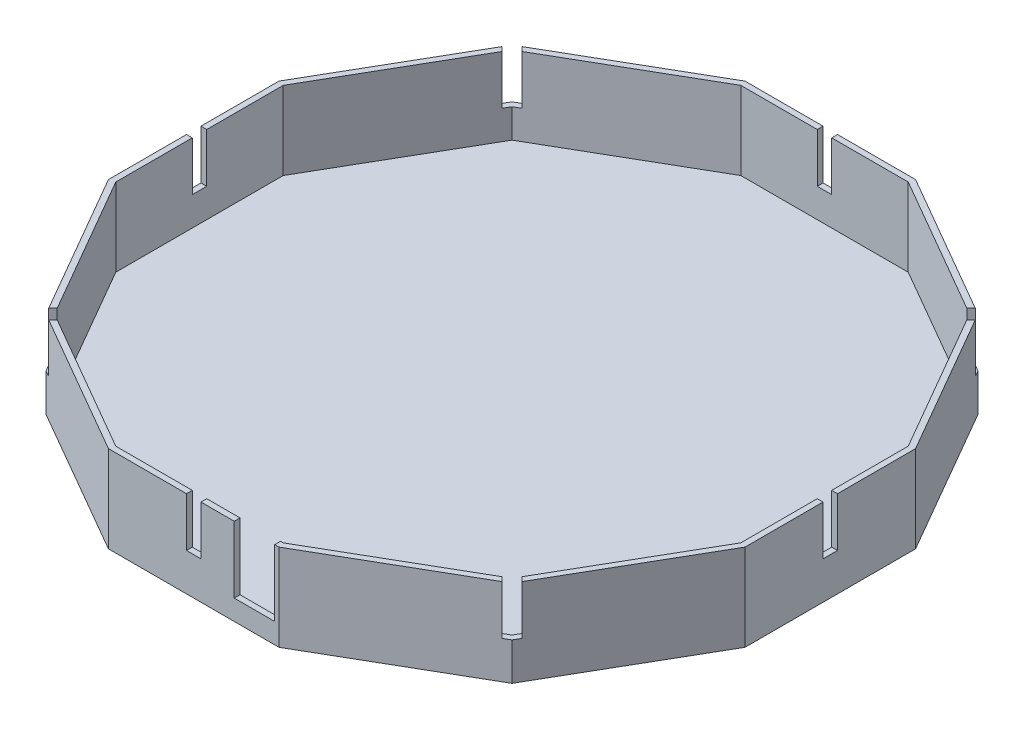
ISO-10303-21;
HEADER;
FILE_DESCRIPTION(('STEP AP214'),'2;1');
FILE_NAME('part.step','',(''),(''),'','','');
FILE_SCHEMA(('AUTOMOTIVE_DESIGN { 1 0 10303 214 1 1 1 1 }'));
ENDSEC;
DATA;
#1=APPLICATION_CONTEXT('core data for automotive mechanical design processes');
#2=APPLICATION_PROTOCOL_DEFINITION('international standard','automotive_design',2000,#1);
#3=PRODUCT_CONTEXT('',#1,'mechanical');
#4=PRODUCT('Part','Part','',(#3));
#5=PRODUCT_RELATED_PRODUCT_CATEGORY('part','',(#4));
#6=PRODUCT_DEFINITION_FORMATION('','',#4);
#7=PRODUCT_DEFINITION_CONTEXT('part definition',#1,'design');
#8=PRODUCT_DEFINITION('design','',#6,#7);
#9=PRODUCT_DEFINITION_SHAPE('','',#8);
#10=(LENGTH_UNIT() NAMED_UNIT(*) SI_UNIT(.MILLI.,.METRE.));
#11=(NAMED_UNIT(*) PLANE_ANGLE_UNIT() SI_UNIT($,.RADIAN.));
#12=(NAMED_UNIT(*) SI_UNIT($,.STERADIAN.) SOLID_ANGLE_UNIT());
#13=UNCERTAINTY_MEASURE_WITH_UNIT(LENGTH_MEASURE(1.E-05),#10,'distance_accuracy_value','');
#14=(GEOMETRIC_REPRESENTATION_CONTEXT(3) GLOBAL_UNCERTAINTY_ASSIGNED_CONTEXT((#13)) GLOBAL_UNIT_ASSIGNED_CONTEXT((#10,
#11,#12)) REPRESENTATION_CONTEXT('',''));
#15=CARTESIAN_POINT('',(0.,0.,0.));
#16=DIRECTION('',(0.,0.,1.));
#17=DIRECTION('',(1.,0.,0.));
#18=AXIS2_PLACEMENT_3D('',#15,#16,#17);
#19=CARTESIAN_POINT('',(0.,30.,0.));
#20=DIRECTION('',(0.,1.,0.));
#21=DIRECTION('',(0.,0.,1.));
#22=AXIS2_PLACEMENT_3D('',#19,#20,#21);
#23=PLANE('',#22);
#24=DIRECTION('',(0.,0.,-1.));
#25=VECTOR('',#24,1.);
#26=CARTESIAN_POINT('',(28.,30.,115.));
#27=LINE('',#26,#25);
#28=CARTESIAN_POINT('',(28.,30.,110.));
#29=VERTEX_POINT('',#28);
#30=CARTESIAN_POINT('',(28.,30.,108.));
#31=VERTEX_POINT('',#30);
#32=EDGE_CURVE('E417',#29,#31,#27,.T.);
#33=ORIENTED_EDGE('',*,*,#32,.F.);
#34=DIRECTION('',(1.,0.,0.));
#35=VECTOR('',#34,1.);
#36=CARTESIAN_POINT('',(-29.4744111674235,30.,110.));
#37=LINE('',#36,#35);
#38=CARTESIAN_POINT('',(29.4744111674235,30.,110.));
#39=VERTEX_POINT('',#38);
#40=EDGE_CURVE('E429',#29,#39,#37,.T.);
#41=ORIENTED_EDGE('',*,*,#40,.T.);
#42=DIRECTION('',(0.866025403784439,0.,-0.5));
#43=VECTOR('',#42,1.);
#44=CARTESIAN_POINT('',(29.4744111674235,30.,110.));
#45=LINE('',#44,#43);
#46=CARTESIAN_POINT('',(78.2841501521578,30.,81.8196840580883));
#47=VERTEX_POINT('',#46);
#48=EDGE_CURVE('E453',#39,#47,#45,.T.);
#49=ORIENTED_EDGE('',*,*,#48,.T.);
#50=DIRECTION('',(0.707106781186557,0.,0.707106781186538));
#51=VECTOR('',#50,1.);
#52=CARTESIAN_POINT('',(63.8983654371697,30.,67.4338993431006));
#53=LINE('',#52,#51);
#54=CARTESIAN_POINT('',(76.82004853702,30.,80.3555824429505));
#55=VERTEX_POINT('',#54);
#56=EDGE_CURVE('E973',#55,#47,#53,.T.);
#57=ORIENTED_EDGE('',*,*,#56,.F.);
#58=DIRECTION('',(0.866025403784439,0.,-0.5));
#59=VECTOR('',#58,1.);
#60=CARTESIAN_POINT('',(28.9385127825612,30.,108.));
#61=LINE('',#60,#59);
#62=CARTESIAN_POINT('',(28.9385127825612,30.,108.));
#63=VERTEX_POINT('',#62);
#64=EDGE_CURVE('E657',#63,#55,#61,.T.);
#65=ORIENTED_EDGE('',*,*,#64,.F.);
#66=DIRECTION('',(1.,0.,0.));
#67=VECTOR('',#66,1.);
#68=CARTESIAN_POINT('',(-28.9385127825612,30.,108.));
#69=LINE('',#68,#67);
#70=EDGE_CURVE('E432',#31,#63,#69,.T.);
#71=ORIENTED_EDGE('',*,*,#70,.F.);
#72=EDGE_LOOP('',(#33,#41,#49,#57,#65,#71));
#73=FACE_BOUND('',#72,.T.);
#74=ADVANCED_FACE('F38',(#73),#23,.T.);
#75=DIRECTION('',(0.,0.,-1.));
#76=VECTOR('',#75,1.);
#77=CARTESIAN_POINT('',(2.50000000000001,30.,-92.8659350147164));
#78=LINE('',#77,#76);
#79=CARTESIAN_POINT('',(2.50000000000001,30.,-108.));
#80=VERTEX_POINT('',#79);
#81=CARTESIAN_POINT('',(2.50000000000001,30.,-110.));
#82=VERTEX_POINT('',#81);
#83=EDGE_CURVE('E985',#80,#82,#78,.T.);
#84=ORIENTED_EDGE('',*,*,#83,.F.);
#85=DIRECTION('',(-1.,0.,0.));
#86=VECTOR('',#85,1.);
#87=CARTESIAN_POINT('',(28.9385127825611,30.,-108.));
#88=LINE('',#87,#86);
#89=CARTESIAN_POINT('',(28.9385127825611,30.,-108.));
#90=VERTEX_POINT('',#89);
#91=EDGE_CURVE('E922',#90,#80,#88,.T.);
#92=ORIENTED_EDGE('',*,*,#91,.F.);
#93=DIRECTION('',(-0.866025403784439,0.,-0.5));
#94=VECTOR('',#93,1.);
#95=CARTESIAN_POINT('',(79.0614872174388,30.,-79.0614872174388));
#96=LINE('',#95,#94);
#97=CARTESIAN_POINT('',(76.8200485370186,30.,-80.3555824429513));
#98=VERTEX_POINT('',#97);
#99=EDGE_CURVE('E918',#98,#90,#96,.T.);
#100=ORIENTED_EDGE('',*,*,#99,.F.);
#101=DIRECTION('',(-0.707106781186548,0.,0.707106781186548));
#102=VECTOR('',#101,1.);
#103=CARTESIAN_POINT('',(63.8983654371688,30.,-67.4338993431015));
#104=LINE('',#103,#102);
#105=CARTESIAN_POINT('',(78.2841501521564,30.,-81.8196840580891));
#106=VERTEX_POINT('',#105);
#107=EDGE_CURVE('E989',#106,#98,#104,.T.);
#108=ORIENTED_EDGE('',*,*,#107,.F.);
#109=DIRECTION('',(-0.866025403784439,0.,-0.5));
#110=VECTOR('',#109,1.);
#111=CARTESIAN_POINT('',(80.5255888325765,30.,-80.5255888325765));
#112=LINE('',#111,#110);
#113=CARTESIAN_POINT('',(29.4744111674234,30.,-110.));
#114=VERTEX_POINT('',#113);
#115=EDGE_CURVE('E716',#106,#114,#112,.T.);
#116=ORIENTED_EDGE('',*,*,#115,.T.);
#117=DIRECTION('',(-1.,0.,0.));
#118=VECTOR('',#117,1.);
#119=CARTESIAN_POINT('',(-29.4744111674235,30.,-110.));
#120=LINE('',#119,#118);
#121=EDGE_CURVE('E720',#114,#82,#120,.T.);
#122=ORIENTED_EDGE('',*,*,#121,.T.);
#123=EDGE_LOOP('',(#84,#92,#100,#108,#116,#122));
#124=FACE_BOUND('',#123,.T.);
#125=ADVANCED_FACE('F1145',(#124),#23,.T.);
#126=DIRECTION('',(0.,0.,1.));
#127=VECTOR('',#126,1.);
#128=CARTESIAN_POINT('',(-2.49999999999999,30.,-92.8659350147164));
#129=LINE('',#128,#127);
#130=CARTESIAN_POINT('',(-2.49999999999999,30.,-110.));
#131=VERTEX_POINT('',#130);
#132=CARTESIAN_POINT('',(-2.49999999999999,30.,-108.));
#133=VERTEX_POINT('',#132);
#134=EDGE_CURVE('E990',#131,#133,#129,.T.);
#135=ORIENTED_EDGE('',*,*,#134,.F.);
#136=CARTESIAN_POINT('',(-29.4744111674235,30.,-110.));
#137=VERTEX_POINT('',#136);
#138=EDGE_CURVE('E719',#131,#137,#120,.T.);
#139=ORIENTED_EDGE('',*,*,#138,.T.);
#140=DIRECTION('',(-0.866025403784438,0.,0.5));
#141=VECTOR('',#140,1.);
#142=CARTESIAN_POINT('',(-29.4744111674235,30.,-110.));
#143=LINE('',#142,#141);
#144=CARTESIAN_POINT('',(-78.2841501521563,30.,-81.8196840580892));
#145=VERTEX_POINT('',#144);
#146=EDGE_CURVE('E724',#137,#145,#143,.T.);
#147=ORIENTED_EDGE('',*,*,#146,.T.);
#148=DIRECTION('',(-0.707106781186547,0.,-0.707106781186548));
#149=VECTOR('',#148,1.);
#150=CARTESIAN_POINT('',(-63.8983654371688,30.,-67.4338993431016));
#151=LINE('',#150,#149);
#152=CARTESIAN_POINT('',(-76.8200485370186,30.,-80.3555824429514));
#153=VERTEX_POINT('',#152);
#154=EDGE_CURVE('E999',#153,#145,#151,.T.);
#155=ORIENTED_EDGE('',*,*,#154,.F.);
#156=DIRECTION('',(-0.866025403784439,0.,0.5));
#157=VECTOR('',#156,1.);
#158=CARTESIAN_POINT('',(-28.9385127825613,30.,-108.));
#159=LINE('',#158,#157);
#160=CARTESIAN_POINT('',(-28.9385127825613,30.,-108.));
#161=VERTEX_POINT('',#160);
#162=EDGE_CURVE('E926',#161,#153,#159,.T.);
#163=ORIENTED_EDGE('',*,*,#162,.F.);
#164=EDGE_CURVE('E921',#133,#161,#88,.T.);
#165=ORIENTED_EDGE('',*,*,#164,.F.);
#166=EDGE_LOOP('',(#135,#139,#147,#155,#163,#165));
#167=FACE_BOUND('',#166,.T.);
#168=ADVANCED_FACE('F1151',(#167),#23,.T.);
#169=DIRECTION('',(0.707106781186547,0.,0.707106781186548));
#170=VECTOR('',#169,1.);
#171=CARTESIAN_POINT('',(-67.4338993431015,30.,-63.8983654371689));
#172=LINE('',#171,#170);
#173=CARTESIAN_POINT('',(-81.8196840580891,30.,-78.2841501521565));
#174=VERTEX_POINT('',#173);
#175=CARTESIAN_POINT('',(-80.3555824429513,30.,-76.8200485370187));
#176=VERTEX_POINT('',#175);
#177=EDGE_CURVE('E1003',#174,#176,#172,.T.);
#178=ORIENTED_EDGE('',*,*,#177,.F.);
#179=DIRECTION('',(-0.5,0.,0.866025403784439));
#180=VECTOR('',#179,1.);
#181=CARTESIAN_POINT('',(-80.5255888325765,30.,-80.5255888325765));
#182=LINE('',#181,#180);
#183=CARTESIAN_POINT('',(-110.,30.,-29.4744111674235));
#184=VERTEX_POINT('',#183);
#185=EDGE_CURVE('E728',#174,#184,#182,.T.);
#186=ORIENTED_EDGE('',*,*,#185,.T.);
#187=DIRECTION('',(0.,0.,1.));
#188=VECTOR('',#187,1.);
#189=CARTESIAN_POINT('',(-110.,30.,-29.4744111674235));
#190=LINE('',#189,#188);
#191=CARTESIAN_POINT('',(-110.,30.,-2.50000000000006));
#192=VERTEX_POINT('',#191);
#193=EDGE_CURVE('E732',#184,#192,#190,.T.);
#194=ORIENTED_EDGE('',*,*,#193,.T.);
#195=DIRECTION('',(-1.,0.,0.));
#196=VECTOR('',#195,1.);
#197=CARTESIAN_POINT('',(-92.8659350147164,30.,-2.50000000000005));
#198=LINE('',#197,#196);
#199=CARTESIAN_POINT('',(-108.,30.,-2.50000000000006));
#200=VERTEX_POINT('',#199);
#201=EDGE_CURVE('E1012',#200,#192,#198,.T.);
#202=ORIENTED_EDGE('',*,*,#201,.F.);
#203=DIRECTION('',(0.,0.,1.));
#204=VECTOR('',#203,1.);
#205=CARTESIAN_POINT('',(-108.,30.,-28.9385127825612));
#206=LINE('',#205,#204);
#207=CARTESIAN_POINT('',(-108.,30.,-28.9385127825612));
#208=VERTEX_POINT('',#207);
#209=EDGE_CURVE('E934',#208,#200,#206,.T.);
#210=ORIENTED_EDGE('',*,*,#209,.F.);
#211=DIRECTION('',(-0.5,0.,0.866025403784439));
#212=VECTOR('',#211,1.);
#213=CARTESIAN_POINT('',(-79.0614872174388,30.,-79.0614872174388));
#214=LINE('',#213,#212);
#215=EDGE_CURVE('E930',#176,#208,#214,.T.);
#216=ORIENTED_EDGE('',*,*,#215,.F.);
#217=EDGE_LOOP('',(#178,#186,#194,#202,#210,#216));
#218=FACE_BOUND('',#217,.T.);
#219=ADVANCED_FACE('F1431',(#218),#23,.T.);
#220=DIRECTION('',(1.,0.,0.));
#221=VECTOR('',#220,1.);
#222=CARTESIAN_POINT('',(-92.8659350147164,30.,2.49999999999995));
#223=LINE('',#222,#221);
#224=CARTESIAN_POINT('',(-110.,30.,2.49999999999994));
#225=VERTEX_POINT('',#224);
#226=CARTESIAN_POINT('',(-108.,30.,2.49999999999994));
#227=VERTEX_POINT('',#226);
#228=EDGE_CURVE('E1016',#225,#227,#223,.T.);
#229=ORIENTED_EDGE('',*,*,#228,.F.);
#230=CARTESIAN_POINT('',(-110.,30.,29.4744111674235));
#231=VERTEX_POINT('',#230);
#232=EDGE_CURVE('E731',#225,#231,#190,.T.);
#233=ORIENTED_EDGE('',*,*,#232,.T.);
#234=DIRECTION('',(0.5,0.,0.866025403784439));
#235=VECTOR('',#234,1.);
#236=CARTESIAN_POINT('',(-110.,30.,29.4744111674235));
#237=LINE('',#236,#235);
#238=CARTESIAN_POINT('',(-81.8196840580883,30.,78.2841501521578));
#239=VERTEX_POINT('',#238);
#240=EDGE_CURVE('E448',#231,#239,#237,.T.);
#241=ORIENTED_EDGE('',*,*,#240,.T.);
#242=DIRECTION('',(-0.707106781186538,0.,0.707106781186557));
#243=VECTOR('',#242,1.);
#244=CARTESIAN_POINT('',(-67.4338993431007,30.,63.8983654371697));
#245=LINE('',#244,#243);
#246=CARTESIAN_POINT('',(-80.3555824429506,30.,76.82004853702));
#247=VERTEX_POINT('',#246);
#248=EDGE_CURVE('E744',#247,#239,#245,.T.);
#249=ORIENTED_EDGE('',*,*,#248,.F.);
#250=DIRECTION('',(0.5,0.,0.866025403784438));
#251=VECTOR('',#250,1.);
#252=CARTESIAN_POINT('',(-108.,30.,28.9385127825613));
#253=LINE('',#252,#251);
#254=CARTESIAN_POINT('',(-108.,30.,28.9385127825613));
#255=VERTEX_POINT('',#254);
#256=EDGE_CURVE('E937',#255,#247,#253,.T.);
#257=ORIENTED_EDGE('',*,*,#256,.F.);
#258=EDGE_CURVE('E933',#227,#255,#206,.T.);
#259=ORIENTED_EDGE('',*,*,#258,.F.);
#260=EDGE_LOOP('',(#229,#233,#241,#249,#257,#259));
#261=FACE_BOUND('',#260,.T.);
#262=ADVANCED_FACE('F742',(#261),#23,.T.);
#263=DIRECTION('',(0.707106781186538,0.,-0.707106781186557));
#264=VECTOR('',#263,1.);
#265=CARTESIAN_POINT('',(-63.8983654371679,30.,67.4338993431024));
#266=LINE('',#265,#264);
#267=CARTESIAN_POINT('',(-78.284150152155,30.,81.8196840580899));
#268=VERTEX_POINT('',#267);
#269=CARTESIAN_POINT('',(-76.8200485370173,30.,80.3555824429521));
#270=VERTEX_POINT('',#269);
#271=EDGE_CURVE('E1027',#268,#270,#266,.T.);
#272=ORIENTED_EDGE('',*,*,#271,.F.);
#273=DIRECTION('',(0.866025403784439,0.,0.5));
#274=VECTOR('',#273,1.);
#275=CARTESIAN_POINT('',(-80.5255888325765,30.,80.5255888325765));
#276=LINE('',#275,#274);
#277=CARTESIAN_POINT('',(-29.4744111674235,30.,110.));
#278=VERTEX_POINT('',#277);
#279=EDGE_CURVE('E442',#268,#278,#276,.T.);
#280=ORIENTED_EDGE('',*,*,#279,.T.);
#281=CARTESIAN_POINT('',(-2.49999999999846,30.,110.));
#282=VERTEX_POINT('',#281);
#283=EDGE_CURVE('E444',#278,#282,#37,.T.);
#284=ORIENTED_EDGE('',*,*,#283,.T.);
#285=DIRECTION('',(0.,0.,1.));
#286=VECTOR('',#285,1.);
#287=CARTESIAN_POINT('',(-2.4999999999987,30.,92.8659350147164));
#288=LINE('',#287,#286);
#289=CARTESIAN_POINT('',(-2.49999999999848,30.,108.));
#290=VERTEX_POINT('',#289);
#291=EDGE_CURVE('E954',#290,#282,#288,.T.);
#292=ORIENTED_EDGE('',*,*,#291,.F.);
#293=CARTESIAN_POINT('',(-28.9385127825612,30.,108.));
#294=VERTEX_POINT('',#293);
#295=EDGE_CURVE('E652',#294,#290,#69,.T.);
#296=ORIENTED_EDGE('',*,*,#295,.F.);
#297=DIRECTION('',(0.866025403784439,0.,0.5));
#298=VECTOR('',#297,1.);
#299=CARTESIAN_POINT('',(-79.0614872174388,30.,79.0614872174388));
#300=LINE('',#299,#298);
#301=EDGE_CURVE('E658',#270,#294,#300,.T.);
#302=ORIENTED_EDGE('',*,*,#301,.F.);
#303=EDGE_LOOP('',(#272,#280,#284,#292,#296,#302));
#304=FACE_BOUND('',#303,.T.);
#305=ADVANCED_FACE('F953',(#304),#23,.T.);
#306=DIRECTION('',(0.,0.,1.));
#307=VECTOR('',#306,1.);
#308=CARTESIAN_POINT('',(14.,30.,115.));
#309=LINE('',#308,#307);
#310=CARTESIAN_POINT('',(14.,30.,108.));
#311=VERTEX_POINT('',#310);
#312=CARTESIAN_POINT('',(14.,30.,110.));
#313=VERTEX_POINT('',#312);
#314=EDGE_CURVE('E434',#311,#313,#309,.T.);
#315=ORIENTED_EDGE('',*,*,#314,.F.);
#316=CARTESIAN_POINT('',(2.50000000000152,30.,108.));
#317=VERTEX_POINT('',#316);
#318=EDGE_CURVE('E644',#317,#311,#69,.T.);
#319=ORIENTED_EDGE('',*,*,#318,.F.);
#320=DIRECTION('',(0.,0.,-1.));
#321=VECTOR('',#320,1.);
#322=CARTESIAN_POINT('',(2.5000000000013,30.,92.8659350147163));
#323=LINE('',#322,#321);
#324=CARTESIAN_POINT('',(2.50000000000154,30.,110.));
#325=VERTEX_POINT('',#324);
#326=EDGE_CURVE('E959',#325,#317,#323,.T.);
#327=ORIENTED_EDGE('',*,*,#326,.F.);
#328=EDGE_CURVE('E441',#325,#313,#37,.T.);
#329=ORIENTED_EDGE('',*,*,#328,.T.);
#330=EDGE_LOOP('',(#315,#319,#327,#329));
#331=FACE_BOUND('',#330,.T.);
#332=ADVANCED_FACE('F642',(#331),#23,.T.);
#333=DIRECTION('',(0.707106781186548,0.,-0.707106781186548));
#334=VECTOR('',#333,1.);
#335=CARTESIAN_POINT('',(67.4338993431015,30.,-63.8983654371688));
#336=LINE('',#335,#334);
#337=CARTESIAN_POINT('',(80.3555824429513,30.,-76.8200485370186));
#338=VERTEX_POINT('',#337);
#339=CARTESIAN_POINT('',(81.8196840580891,30.,-78.2841501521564));
#340=VERTEX_POINT('',#339);
#341=EDGE_CURVE('E1035',#338,#340,#336,.T.);
#342=ORIENTED_EDGE('',*,*,#341,.F.);
#343=DIRECTION('',(-0.5,0.,-0.866025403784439));
#344=VECTOR('',#343,1.);
#345=CARTESIAN_POINT('',(108.,30.,-28.9385127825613));
#346=LINE('',#345,#344);
#347=CARTESIAN_POINT('',(108.,30.,-28.9385127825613));
#348=VERTEX_POINT('',#347);
#349=EDGE_CURVE('E914',#348,#338,#346,.T.);
#350=ORIENTED_EDGE('',*,*,#349,.F.);
#351=DIRECTION('',(0.,0.,-1.));
#352=VECTOR('',#351,1.);
#353=CARTESIAN_POINT('',(108.,30.,28.9385127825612));
#354=LINE('',#353,#352);
#355=CARTESIAN_POINT('',(108.,30.,-2.5));
#356=VERTEX_POINT('',#355);
#357=EDGE_CURVE('E909',#356,#348,#354,.T.);
#358=ORIENTED_EDGE('',*,*,#357,.F.);
#359=DIRECTION('',(-1.,0.,0.));
#360=VECTOR('',#359,1.);
#361=CARTESIAN_POINT('',(92.8659350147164,30.,-2.5));
#362=LINE('',#361,#360);
#363=CARTESIAN_POINT('',(110.,30.,-2.5));
#364=VERTEX_POINT('',#363);
#365=EDGE_CURVE('E833',#364,#356,#362,.T.);
#366=ORIENTED_EDGE('',*,*,#365,.F.);
#367=DIRECTION('',(0.,0.,-1.));
#368=VECTOR('',#367,1.);
#369=CARTESIAN_POINT('',(110.,30.,-29.4744111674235));
#370=LINE('',#369,#368);
#371=CARTESIAN_POINT('',(110.,30.,-29.4744111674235));
#372=VERTEX_POINT('',#371);
#373=EDGE_CURVE('E506',#364,#372,#370,.T.);
#374=ORIENTED_EDGE('',*,*,#373,.T.);
#375=DIRECTION('',(-0.5,0.,-0.866025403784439));
#376=VECTOR('',#375,1.);
#377=CARTESIAN_POINT('',(110.,30.,-29.4744111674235));
#378=LINE('',#377,#376);
#379=EDGE_CURVE('E712',#372,#340,#378,.T.);
#380=ORIENTED_EDGE('',*,*,#379,.T.);
#381=EDGE_LOOP('',(#342,#350,#358,#366,#374,#380));
#382=FACE_BOUND('',#381,.T.);
#383=ADVANCED_FACE('F1156',(#382),#23,.T.);
#384=DIRECTION('',(-0.707106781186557,0.,-0.707106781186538));
#385=VECTOR('',#384,1.);
#386=CARTESIAN_POINT('',(67.4338993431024,30.,63.8983654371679));
#387=LINE('',#386,#385);
#388=CARTESIAN_POINT('',(81.8196840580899,30.,78.284150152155));
#389=VERTEX_POINT('',#388);
#390=CARTESIAN_POINT('',(80.3555824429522,30.,76.8200485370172));
#391=VERTEX_POINT('',#390);
#392=EDGE_CURVE('E423',#389,#391,#387,.T.);
#393=ORIENTED_EDGE('',*,*,#392,.F.);
#394=DIRECTION('',(0.5,0.,-0.866025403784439));
#395=VECTOR('',#394,1.);
#396=CARTESIAN_POINT('',(80.5255888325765,30.,80.5255888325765));
#397=LINE('',#396,#395);
#398=CARTESIAN_POINT('',(110.,30.,29.4744111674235));
#399=VERTEX_POINT('',#398);
#400=EDGE_CURVE('E458',#389,#399,#397,.T.);
#401=ORIENTED_EDGE('',*,*,#400,.T.);
#402=CARTESIAN_POINT('',(110.,30.,2.5));
#403=VERTEX_POINT('',#402);
#404=EDGE_CURVE('E708',#399,#403,#370,.T.);
#405=ORIENTED_EDGE('',*,*,#404,.T.);
#406=DIRECTION('',(1.,0.,0.));
#407=VECTOR('',#406,1.);
#408=CARTESIAN_POINT('',(92.8659350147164,30.,2.5));
#409=LINE('',#408,#407);
#410=CARTESIAN_POINT('',(108.,30.,2.5));
#411=VERTEX_POINT('',#410);
#412=EDGE_CURVE('E838',#411,#403,#409,.T.);
#413=ORIENTED_EDGE('',*,*,#412,.F.);
#414=CARTESIAN_POINT('',(108.,30.,28.9385127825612));
#415=VERTEX_POINT('',#414);
#416=EDGE_CURVE('E910',#415,#411,#354,.T.);
#417=ORIENTED_EDGE('',*,*,#416,.F.);
#418=DIRECTION('',(0.5,0.,-0.866025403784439));
#419=VECTOR('',#418,1.);
#420=CARTESIAN_POINT('',(79.0614872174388,30.,79.0614872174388));
#421=LINE('',#420,#419);
#422=EDGE_CURVE('E906',#391,#415,#421,.T.);
#423=ORIENTED_EDGE('',*,*,#422,.F.);
#424=EDGE_LOOP('',(#393,#401,#405,#413,#417,#423));
#425=FACE_BOUND('',#424,.T.);
#426=ADVANCED_FACE('F1147',(#425),#23,.T.);
#427=CARTESIAN_POINT('',(0.,0.,0.));
#428=DIRECTION('',(0.,1.,0.));
#429=DIRECTION('',(0.,0.,1.));
#430=AXIS2_PLACEMENT_3D('',#427,#428,#429);
#431=PLANE('',#430);
#432=DIRECTION('',(0.,0.,-1.));
#433=VECTOR('',#432,1.);
#434=CARTESIAN_POINT('',(110.,0.,-29.4744111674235));
#435=LINE('',#434,#433);
#436=CARTESIAN_POINT('',(110.,0.,29.4744111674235));
#437=VERTEX_POINT('',#436);
#438=CARTESIAN_POINT('',(110.,0.,-29.4744111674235));
#439=VERTEX_POINT('',#438);
#440=EDGE_CURVE('E464',#437,#439,#435,.T.);
#441=ORIENTED_EDGE('',*,*,#440,.F.);
#442=DIRECTION('',(0.5,0.,-0.866025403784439));
#443=VECTOR('',#442,1.);
#444=CARTESIAN_POINT('',(80.5255888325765,0.,80.5255888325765));
#445=LINE('',#444,#443);
#446=CARTESIAN_POINT('',(80.5255888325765,0.,80.5255888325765));
#447=VERTEX_POINT('',#446);
#448=EDGE_CURVE('E503',#447,#437,#445,.T.);
#449=ORIENTED_EDGE('',*,*,#448,.F.);
#450=DIRECTION('',(0.866025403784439,0.,-0.5));
#451=VECTOR('',#450,1.);
#452=CARTESIAN_POINT('',(29.4744111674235,0.,110.));
#453=LINE('',#452,#451);
#454=CARTESIAN_POINT('',(29.4744111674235,0.,110.));
#455=VERTEX_POINT('',#454);
#456=EDGE_CURVE('E499',#455,#447,#453,.T.);
#457=ORIENTED_EDGE('',*,*,#456,.F.);
#458=DIRECTION('',(1.,0.,0.));
#459=VECTOR('',#458,1.);
#460=CARTESIAN_POINT('',(-29.4744111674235,0.,110.));
#461=LINE('',#460,#459);
#462=CARTESIAN_POINT('',(-29.4744111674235,0.,110.));
#463=VERTEX_POINT('',#462);
#464=EDGE_CURVE('E496',#463,#455,#461,.T.);
#465=ORIENTED_EDGE('',*,*,#464,.F.);
#466=DIRECTION('',(0.866025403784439,0.,0.5));
#467=VECTOR('',#466,1.);
#468=CARTESIAN_POINT('',(-80.5255888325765,0.,80.5255888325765));
#469=LINE('',#468,#467);
#470=CARTESIAN_POINT('',(-80.5255888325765,0.,80.5255888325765));
#471=VERTEX_POINT('',#470);
#472=EDGE_CURVE('E493',#471,#463,#469,.T.);
#473=ORIENTED_EDGE('',*,*,#472,.F.);
#474=DIRECTION('',(0.5,0.,0.866025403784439));
#475=VECTOR('',#474,1.);
#476=CARTESIAN_POINT('',(-110.,0.,29.4744111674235));
#477=LINE('',#476,#475);
#478=CARTESIAN_POINT('',(-110.,0.,29.4744111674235));
#479=VERTEX_POINT('',#478);
#480=EDGE_CURVE('E489',#479,#471,#477,.T.);
#481=ORIENTED_EDGE('',*,*,#480,.F.);
#482=DIRECTION('',(0.,0.,1.));
#483=VECTOR('',#482,1.);
#484=CARTESIAN_POINT('',(-110.,0.,-29.4744111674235));
#485=LINE('',#484,#483);
#486=CARTESIAN_POINT('',(-110.,0.,-29.4744111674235));
#487=VERTEX_POINT('',#486);
#488=EDGE_CURVE('E486',#487,#479,#485,.T.);
#489=ORIENTED_EDGE('',*,*,#488,.F.);
#490=DIRECTION('',(-0.5,0.,0.866025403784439));
#491=VECTOR('',#490,1.);
#492=CARTESIAN_POINT('',(-80.5255888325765,0.,-80.5255888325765));
#493=LINE('',#492,#491);
#494=CARTESIAN_POINT('',(-80.5255888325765,0.,-80.5255888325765));
#495=VERTEX_POINT('',#494);
#496=EDGE_CURVE('E483',#495,#487,#493,.T.);
#497=ORIENTED_EDGE('',*,*,#496,.F.);
#498=DIRECTION('',(-0.866025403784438,0.,0.5));
#499=VECTOR('',#498,1.);
#500=CARTESIAN_POINT('',(-29.4744111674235,0.,-110.));
#501=LINE('',#500,#499);
#502=CARTESIAN_POINT('',(-29.4744111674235,0.,-110.));
#503=VERTEX_POINT('',#502);
#504=EDGE_CURVE('E479',#503,#495,#501,.T.);
#505=ORIENTED_EDGE('',*,*,#504,.F.);
#506=DIRECTION('',(-1.,0.,0.));
#507=VECTOR('',#506,1.);
#508=CARTESIAN_POINT('',(-29.4744111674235,0.,-110.));
#509=LINE('',#508,#507);
#510=CARTESIAN_POINT('',(29.4744111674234,0.,-110.));
#511=VERTEX_POINT('',#510);
#512=EDGE_CURVE('E476',#511,#503,#509,.T.);
#513=ORIENTED_EDGE('',*,*,#512,.F.);
#514=DIRECTION('',(-0.866025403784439,0.,-0.5));
#515=VECTOR('',#514,1.);
#516=CARTESIAN_POINT('',(80.5255888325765,0.,-80.5255888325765));
#517=LINE('',#516,#515);
#518=CARTESIAN_POINT('',(80.5255888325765,0.,-80.5255888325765));
#519=VERTEX_POINT('',#518);
#520=EDGE_CURVE('E473',#519,#511,#517,.T.);
#521=ORIENTED_EDGE('',*,*,#520,.F.);
#522=DIRECTION('',(-0.5,0.,-0.866025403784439));
#523=VECTOR('',#522,1.);
#524=CARTESIAN_POINT('',(110.,0.,-29.4744111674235));
#525=LINE('',#524,#523);
#526=EDGE_CURVE('E468',#439,#519,#525,.T.);
#527=ORIENTED_EDGE('',*,*,#526,.F.);
#528=EDGE_LOOP('',(#441,#449,#457,#465,#473,#481,#489,#497,#505,#513,#521,#527));
#529=FACE_BOUND('',#528,.T.);
#530=ADVANCED_FACE('F1103',(#529),#431,.F.);
#531=CARTESIAN_POINT('',(110.,30.,-29.4744111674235));
#532=DIRECTION('',(-1.,0.,0.));
#533=DIRECTION('',(0.,0.,1.));
#534=AXIS2_PLACEMENT_3D('',#531,#532,#533);
#535=PLANE('',#534);
#536=DIRECTION('',(0.,0.,1.));
#537=VECTOR('',#536,1.);
#538=CARTESIAN_POINT('',(110.,13.,-29.4744111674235));
#539=LINE('',#538,#537);
#540=CARTESIAN_POINT('',(110.,13.,-2.5));
#541=VERTEX_POINT('',#540);
#542=CARTESIAN_POINT('',(110.,13.,2.5));
#543=VERTEX_POINT('',#542);
#544=EDGE_CURVE('E842',#541,#543,#539,.T.);
#545=ORIENTED_EDGE('',*,*,#544,.T.);
#546=DIRECTION('',(0.,1.,0.));
#547=VECTOR('',#546,1.);
#548=CARTESIAN_POINT('',(110.,30.,2.5));
#549=LINE('',#548,#547);
#550=EDGE_CURVE('E854',#543,#403,#549,.T.);
#551=ORIENTED_EDGE('',*,*,#550,.T.);
#552=ORIENTED_EDGE('',*,*,#404,.F.);
#553=DIRECTION('',(0.,-1.,0.));
#554=VECTOR('',#553,1.);
#555=CARTESIAN_POINT('',(110.,30.,29.4744111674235));
#556=LINE('',#555,#554);
#557=EDGE_CURVE('E461',#399,#437,#556,.T.);
#558=ORIENTED_EDGE('',*,*,#557,.T.);
#559=ORIENTED_EDGE('',*,*,#440,.T.);
#560=DIRECTION('',(0.,-1.,0.));
#561=VECTOR('',#560,1.);
#562=CARTESIAN_POINT('',(110.,30.,-29.4744111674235));
#563=LINE('',#562,#561);
#564=EDGE_CURVE('E544',#372,#439,#563,.T.);
#565=ORIENTED_EDGE('',*,*,#564,.F.);
#566=ORIENTED_EDGE('',*,*,#373,.F.);
#567=DIRECTION('',(0.,-1.,0.));
#568=VECTOR('',#567,1.);
#569=CARTESIAN_POINT('',(110.,30.,-2.5));
#570=LINE('',#569,#568);
#571=EDGE_CURVE('E850',#364,#541,#570,.T.);
#572=ORIENTED_EDGE('',*,*,#571,.T.);
#573=EDGE_LOOP('',(#545,#551,#552,#558,#559,#565,#566,#572));
#574=FACE_BOUND('',#573,.T.);
#575=ADVANCED_FACE('F40',(#574),#535,.F.);
#576=CARTESIAN_POINT('',(110.,30.,-29.4744111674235));
#577=DIRECTION('',(-0.866025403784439,0.,0.5));
#578=DIRECTION('',(0.5,0.,0.866025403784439));
#579=AXIS2_PLACEMENT_3D('',#576,#577,#578);
#580=PLANE('',#579);
#581=DIRECTION('',(0.5,0.,0.866025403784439));
#582=VECTOR('',#581,1.);
#583=CARTESIAN_POINT('',(110.,13.,-29.4744111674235));
#584=LINE('',#583,#582);
#585=CARTESIAN_POINT('',(80.5255888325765,13.,-80.5255888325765));
#586=VERTEX_POINT('',#585);
#587=CARTESIAN_POINT('',(81.8196840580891,13.,-78.2841501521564));
#588=VERTEX_POINT('',#587);
#589=EDGE_CURVE('E817',#586,#588,#584,.T.);
#590=ORIENTED_EDGE('',*,*,#589,.T.);
#591=DIRECTION('',(0.,1.,0.));
#592=VECTOR('',#591,1.);
#593=CARTESIAN_POINT('',(81.8196840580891,30.,-78.2841501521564));
#594=LINE('',#593,#592);
#595=EDGE_CURVE('E825',#588,#340,#594,.T.);
#596=ORIENTED_EDGE('',*,*,#595,.T.);
#597=ORIENTED_EDGE('',*,*,#379,.F.);
#598=ORIENTED_EDGE('',*,*,#564,.T.);
#599=ORIENTED_EDGE('',*,*,#526,.T.);
#600=DIRECTION('',(0.,-1.,0.));
#601=VECTOR('',#600,1.);
#602=CARTESIAN_POINT('',(80.5255888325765,30.,-80.5255888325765));
#603=LINE('',#602,#601);
#604=EDGE_CURVE('E541',#586,#519,#603,.T.);
#605=ORIENTED_EDGE('',*,*,#604,.F.);
#606=EDGE_LOOP('',(#590,#596,#597,#598,#599,#605));
#607=FACE_BOUND('',#606,.T.);
#608=ADVANCED_FACE('F1232',(#607),#580,.F.);
#609=CARTESIAN_POINT('',(80.5255888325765,30.,-80.5255888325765));
#610=DIRECTION('',(-0.5,0.,0.866025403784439));
#611=DIRECTION('',(0.866025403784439,0.,0.5));
#612=AXIS2_PLACEMENT_3D('',#609,#610,#611);
#613=PLANE('',#612);
#614=ORIENTED_EDGE('',*,*,#115,.F.);
#615=DIRECTION('',(0.,-1.,0.));
#616=VECTOR('',#615,1.);
#617=CARTESIAN_POINT('',(78.2841501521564,30.,-81.8196840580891));
#618=LINE('',#617,#616);
#619=CARTESIAN_POINT('',(78.2841501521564,13.,-81.8196840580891));
#620=VERTEX_POINT('',#619);
#621=EDGE_CURVE('E821',#106,#620,#618,.T.);
#622=ORIENTED_EDGE('',*,*,#621,.T.);
#623=DIRECTION('',(0.866025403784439,0.,0.5));
#624=VECTOR('',#623,1.);
#625=CARTESIAN_POINT('',(80.5255888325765,13.,-80.5255888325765));
#626=LINE('',#625,#624);
#627=EDGE_CURVE('E813',#620,#586,#626,.T.);
#628=ORIENTED_EDGE('',*,*,#627,.T.);
#629=ORIENTED_EDGE('',*,*,#604,.T.);
#630=ORIENTED_EDGE('',*,*,#520,.T.);
#631=DIRECTION('',(0.,-1.,0.));
#632=VECTOR('',#631,1.);
#633=CARTESIAN_POINT('',(29.4744111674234,30.,-110.));
#634=LINE('',#633,#632);
#635=EDGE_CURVE('E537',#114,#511,#634,.T.);
#636=ORIENTED_EDGE('',*,*,#635,.F.);
#637=EDGE_LOOP('',(#614,#622,#628,#629,#630,#636));
#638=FACE_BOUND('',#637,.T.);
#639=ADVANCED_FACE('F1237',(#638),#613,.F.);
#640=CARTESIAN_POINT('',(-29.4744111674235,30.,-110.));
#641=DIRECTION('',(0.,0.,1.));
#642=DIRECTION('',(1.,0.,0.));
#643=AXIS2_PLACEMENT_3D('',#640,#641,#642);
#644=PLANE('',#643);
#645=DIRECTION('',(1.,0.,0.));
#646=VECTOR('',#645,1.);
#647=CARTESIAN_POINT('',(-29.4744111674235,13.,-110.));
#648=LINE('',#647,#646);
#649=CARTESIAN_POINT('',(-2.49999999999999,13.,-110.));
#650=VERTEX_POINT('',#649);
#651=CARTESIAN_POINT('',(2.50000000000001,13.,-110.));
#652=VERTEX_POINT('',#651);
#653=EDGE_CURVE('E798',#650,#652,#648,.T.);
#654=ORIENTED_EDGE('',*,*,#653,.T.);
#655=DIRECTION('',(0.,1.,0.));
#656=VECTOR('',#655,1.);
#657=CARTESIAN_POINT('',(2.5,30.,-110.));
#658=LINE('',#657,#656);
#659=EDGE_CURVE('E806',#652,#82,#658,.T.);
#660=ORIENTED_EDGE('',*,*,#659,.T.);
#661=ORIENTED_EDGE('',*,*,#121,.F.);
#662=ORIENTED_EDGE('',*,*,#635,.T.);
#663=ORIENTED_EDGE('',*,*,#512,.T.);
#664=DIRECTION('',(0.,-1.,0.));
#665=VECTOR('',#664,1.);
#666=CARTESIAN_POINT('',(-29.4744111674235,30.,-110.));
#667=LINE('',#666,#665);
#668=EDGE_CURVE('E533',#137,#503,#667,.T.);
#669=ORIENTED_EDGE('',*,*,#668,.F.);
#670=ORIENTED_EDGE('',*,*,#138,.F.);
#671=DIRECTION('',(0.,-1.,0.));
#672=VECTOR('',#671,1.);
#673=CARTESIAN_POINT('',(-2.5,30.,-110.));
#674=LINE('',#673,#672);
#675=EDGE_CURVE('E802',#131,#650,#674,.T.);
#676=ORIENTED_EDGE('',*,*,#675,.T.);
#677=EDGE_LOOP('',(#654,#660,#661,#662,#663,#669,#670,#676));
#678=FACE_BOUND('',#677,.T.);
#679=ADVANCED_FACE('F1204',(#678),#644,.F.);
#680=CARTESIAN_POINT('',(-29.4744111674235,30.,-110.));
#681=DIRECTION('',(0.5,0.,0.866025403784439));
#682=DIRECTION('',(0.866025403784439,0.,-0.5));
#683=AXIS2_PLACEMENT_3D('',#680,#681,#682);
#684=PLANE('',#683);
#685=DIRECTION('',(0.866025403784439,0.,-0.5));
#686=VECTOR('',#685,1.);
#687=CARTESIAN_POINT('',(-29.4744111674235,13.,-110.));
#688=LINE('',#687,#686);
#689=CARTESIAN_POINT('',(-80.5255888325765,13.,-80.5255888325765));
#690=VERTEX_POINT('',#689);
#691=CARTESIAN_POINT('',(-78.2841501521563,13.,-81.8196840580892));
#692=VERTEX_POINT('',#691);
#693=EDGE_CURVE('E786',#690,#692,#688,.T.);
#694=ORIENTED_EDGE('',*,*,#693,.T.);
#695=DIRECTION('',(0.,1.,0.));
#696=VECTOR('',#695,1.);
#697=CARTESIAN_POINT('',(-78.2841501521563,30.,-81.8196840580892));
#698=LINE('',#697,#696);
#699=EDGE_CURVE('E794',#692,#145,#698,.T.);
#700=ORIENTED_EDGE('',*,*,#699,.T.);
#701=ORIENTED_EDGE('',*,*,#146,.F.);
#702=ORIENTED_EDGE('',*,*,#668,.T.);
#703=ORIENTED_EDGE('',*,*,#504,.T.);
#704=DIRECTION('',(0.,-1.,0.));
#705=VECTOR('',#704,1.);
#706=CARTESIAN_POINT('',(-80.5255888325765,30.,-80.5255888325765));
#707=LINE('',#706,#705);
#708=EDGE_CURVE('E530',#690,#495,#707,.T.);
#709=ORIENTED_EDGE('',*,*,#708,.F.);
#710=EDGE_LOOP('',(#694,#700,#701,#702,#703,#709));
#711=FACE_BOUND('',#710,.T.);
#712=ADVANCED_FACE('F1248',(#711),#684,.F.);
#713=CARTESIAN_POINT('',(-80.5255888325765,30.,-80.5255888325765));
#714=DIRECTION('',(0.866025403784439,0.,0.5));
#715=DIRECTION('',(0.5,0.,-0.866025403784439));
#716=AXIS2_PLACEMENT_3D('',#713,#714,#715);
#717=PLANE('',#716);
#718=ORIENTED_EDGE('',*,*,#185,.F.);
#719=DIRECTION('',(0.,-1.,0.));
#720=VECTOR('',#719,1.);
#721=CARTESIAN_POINT('',(-81.8196840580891,30.,-78.2841501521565));
#722=LINE('',#721,#720);
#723=CARTESIAN_POINT('',(-81.8196840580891,13.,-78.2841501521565));
#724=VERTEX_POINT('',#723);
#725=EDGE_CURVE('E790',#174,#724,#722,.T.);
#726=ORIENTED_EDGE('',*,*,#725,.T.);
#727=DIRECTION('',(0.5,0.,-0.866025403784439));
#728=VECTOR('',#727,1.);
#729=CARTESIAN_POINT('',(-80.5255888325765,13.,-80.5255888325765));
#730=LINE('',#729,#728);
#731=EDGE_CURVE('E782',#724,#690,#730,.T.);
#732=ORIENTED_EDGE('',*,*,#731,.T.);
#733=ORIENTED_EDGE('',*,*,#708,.T.);
#734=ORIENTED_EDGE('',*,*,#496,.T.);
#735=DIRECTION('',(0.,-1.,0.));
#736=VECTOR('',#735,1.);
#737=CARTESIAN_POINT('',(-110.,30.,-29.4744111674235));
#738=LINE('',#737,#736);
#739=EDGE_CURVE('E526',#184,#487,#738,.T.);
#740=ORIENTED_EDGE('',*,*,#739,.F.);
#741=EDGE_LOOP('',(#718,#726,#732,#733,#734,#740));
#742=FACE_BOUND('',#741,.T.);
#743=ADVANCED_FACE('F1318',(#742),#717,.F.);
#744=CARTESIAN_POINT('',(-110.,30.,-29.4744111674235));
#745=DIRECTION('',(1.,0.,0.));
#746=DIRECTION('',(0.,0.,-1.));
#747=AXIS2_PLACEMENT_3D('',#744,#745,#746);
#748=PLANE('',#747);
#749=DIRECTION('',(0.,0.,-1.));
#750=VECTOR('',#749,1.);
#751=CARTESIAN_POINT('',(-110.,13.,-29.4744111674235));
#752=LINE('',#751,#750);
#753=CARTESIAN_POINT('',(-110.,13.,2.49999999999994));
#754=VERTEX_POINT('',#753);
#755=CARTESIAN_POINT('',(-110.,13.,-2.50000000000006));
#756=VERTEX_POINT('',#755);
#757=EDGE_CURVE('E760',#754,#756,#752,.T.);
#758=ORIENTED_EDGE('',*,*,#757,.T.);
#759=DIRECTION('',(0.,1.,0.));
#760=VECTOR('',#759,1.);
#761=CARTESIAN_POINT('',(-110.,30.,-2.50000000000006));
#762=LINE('',#761,#760);
#763=EDGE_CURVE('E775',#756,#192,#762,.T.);
#764=ORIENTED_EDGE('',*,*,#763,.T.);
#765=ORIENTED_EDGE('',*,*,#193,.F.);
#766=ORIENTED_EDGE('',*,*,#739,.T.);
#767=ORIENTED_EDGE('',*,*,#488,.T.);
#768=DIRECTION('',(0.,-1.,0.));
#769=VECTOR('',#768,1.);
#770=CARTESIAN_POINT('',(-110.,30.,29.4744111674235));
#771=LINE('',#770,#769);
#772=EDGE_CURVE('E522',#231,#479,#771,.T.);
#773=ORIENTED_EDGE('',*,*,#772,.F.);
#774=ORIENTED_EDGE('',*,*,#232,.F.);
#775=DIRECTION('',(0.,-1.,0.));
#776=VECTOR('',#775,1.);
#777=CARTESIAN_POINT('',(-110.,30.,2.49999999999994));
#778=LINE('',#777,#776);
#779=EDGE_CURVE('E766',#225,#754,#778,.T.);
#780=ORIENTED_EDGE('',*,*,#779,.T.);
#781=EDGE_LOOP('',(#758,#764,#765,#766,#767,#773,#774,#780));
#782=FACE_BOUND('',#781,.T.);
#783=ADVANCED_FACE('F1315',(#782),#748,.F.);
#784=CARTESIAN_POINT('',(-110.,30.,29.4744111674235));
#785=DIRECTION('',(0.866025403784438,0.,-0.5));
#786=DIRECTION('',(-0.5,0.,-0.866025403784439));
#787=AXIS2_PLACEMENT_3D('',#784,#785,#786);
#788=PLANE('',#787);
#789=DIRECTION('',(-0.5,0.,-0.866025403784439));
#790=VECTOR('',#789,1.);
#791=CARTESIAN_POINT('',(-110.,13.,29.4744111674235));
#792=LINE('',#791,#790);
#793=CARTESIAN_POINT('',(-80.5255888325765,13.,80.5255888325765));
#794=VERTEX_POINT('',#793);
#795=CARTESIAN_POINT('',(-81.8196840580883,13.,78.2841501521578));
#796=VERTEX_POINT('',#795);
#797=EDGE_CURVE('E755',#794,#796,#792,.T.);
#798=ORIENTED_EDGE('',*,*,#797,.T.);
#799=DIRECTION('',(0.,1.,0.));
#800=VECTOR('',#799,1.);
#801=CARTESIAN_POINT('',(-81.8196840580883,30.,78.2841501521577));
#802=LINE('',#801,#800);
#803=EDGE_CURVE('E753',#796,#239,#802,.T.);
#804=ORIENTED_EDGE('',*,*,#803,.T.);
#805=ORIENTED_EDGE('',*,*,#240,.F.);
#806=ORIENTED_EDGE('',*,*,#772,.T.);
#807=ORIENTED_EDGE('',*,*,#480,.T.);
#808=DIRECTION('',(0.,-1.,0.));
#809=VECTOR('',#808,1.);
#810=CARTESIAN_POINT('',(-80.5255888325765,30.,80.5255888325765));
#811=LINE('',#810,#809);
#812=EDGE_CURVE('E519',#794,#471,#811,.T.);
#813=ORIENTED_EDGE('',*,*,#812,.F.);
#814=EDGE_LOOP('',(#798,#804,#805,#806,#807,#813));
#815=FACE_BOUND('',#814,.T.);
#816=ADVANCED_FACE('F751',(#815),#788,.F.);
#817=CARTESIAN_POINT('',(-80.5255888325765,30.,80.5255888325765));
#818=DIRECTION('',(0.5,0.,-0.866025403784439));
#819=DIRECTION('',(-0.866025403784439,0.,-0.5));
#820=AXIS2_PLACEMENT_3D('',#817,#818,#819);
#821=PLANE('',#820);
#822=ORIENTED_EDGE('',*,*,#279,.F.);
#823=DIRECTION('',(0.,-1.,0.));
#824=VECTOR('',#823,1.);
#825=CARTESIAN_POINT('',(-78.284150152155,30.,81.8196840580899));
#826=LINE('',#825,#824);
#827=CARTESIAN_POINT('',(-78.284150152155,13.,81.8196840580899));
#828=VERTEX_POINT('',#827);
#829=EDGE_CURVE('E761',#268,#828,#826,.T.);
#830=ORIENTED_EDGE('',*,*,#829,.T.);
#831=DIRECTION('',(-0.866025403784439,0.,-0.5));
#832=VECTOR('',#831,1.);
#833=CARTESIAN_POINT('',(-80.5255888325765,13.,80.5255888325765));
#834=LINE('',#833,#832);
#835=EDGE_CURVE('E1072',#828,#794,#834,.T.);
#836=ORIENTED_EDGE('',*,*,#835,.T.);
#837=ORIENTED_EDGE('',*,*,#812,.T.);
#838=ORIENTED_EDGE('',*,*,#472,.T.);
#839=DIRECTION('',(0.,-1.,0.));
#840=VECTOR('',#839,1.);
#841=CARTESIAN_POINT('',(-29.4744111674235,30.,110.));
#842=LINE('',#841,#840);
#843=EDGE_CURVE('E515',#278,#463,#842,.T.);
#844=ORIENTED_EDGE('',*,*,#843,.F.);
#845=EDGE_LOOP('',(#822,#830,#836,#837,#838,#844));
#846=FACE_BOUND('',#845,.T.);
#847=ADVANCED_FACE('F1310',(#846),#821,.F.);
#848=CARTESIAN_POINT('',(-29.4744111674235,30.,110.));
#849=DIRECTION('',(0.,0.,-1.));
#850=DIRECTION('',(-1.,0.,0.));
#851=AXIS2_PLACEMENT_3D('',#848,#849,#850);
#852=PLANE('',#851);
#853=ORIENTED_EDGE('',*,*,#40,.F.);
#854=DIRECTION('',(0.,-1.,0.));
#855=VECTOR('',#854,1.);
#856=CARTESIAN_POINT('',(28.,30.,110.));
#857=LINE('',#856,#855);
#858=CARTESIAN_POINT('',(28.,7.,110.));
#859=VERTEX_POINT('',#858);
#860=EDGE_CURVE('E414',#29,#859,#857,.T.);
#861=ORIENTED_EDGE('',*,*,#860,.T.);
#862=DIRECTION('',(-1.,0.,0.));
#863=VECTOR('',#862,1.);
#864=CARTESIAN_POINT('',(-29.4744111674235,7.,110.));
#865=LINE('',#864,#863);
#866=CARTESIAN_POINT('',(14.,7.,110.));
#867=VERTEX_POINT('',#866);
#868=EDGE_CURVE('E1083',#859,#867,#865,.T.);
#869=ORIENTED_EDGE('',*,*,#868,.T.);
#870=DIRECTION('',(0.,1.,0.));
#871=VECTOR('',#870,1.);
#872=CARTESIAN_POINT('',(14.,30.,110.));
#873=LINE('',#872,#871);
#874=EDGE_CURVE('E424',#867,#313,#873,.T.);
#875=ORIENTED_EDGE('',*,*,#874,.T.);
#876=ORIENTED_EDGE('',*,*,#328,.F.);
#877=DIRECTION('',(0.,-1.,0.));
#878=VECTOR('',#877,1.);
#879=CARTESIAN_POINT('',(2.50000000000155,30.,110.));
#880=LINE('',#879,#878);
#881=CARTESIAN_POINT('',(2.50000000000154,13.,110.));
#882=VERTEX_POINT('',#881);
#883=EDGE_CURVE('E1062',#325,#882,#880,.T.);
#884=ORIENTED_EDGE('',*,*,#883,.T.);
#885=DIRECTION('',(-1.,0.,0.));
#886=VECTOR('',#885,1.);
#887=CARTESIAN_POINT('',(-29.4744111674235,13.,110.));
#888=LINE('',#887,#886);
#889=CARTESIAN_POINT('',(-2.49999999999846,13.,110.));
#890=VERTEX_POINT('',#889);
#891=EDGE_CURVE('E1058',#882,#890,#888,.T.);
#892=ORIENTED_EDGE('',*,*,#891,.T.);
#893=DIRECTION('',(0.,1.,0.));
#894=VECTOR('',#893,1.);
#895=CARTESIAN_POINT('',(-2.49999999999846,30.,110.));
#896=LINE('',#895,#894);
#897=EDGE_CURVE('E1066',#890,#282,#896,.T.);
#898=ORIENTED_EDGE('',*,*,#897,.T.);
#899=ORIENTED_EDGE('',*,*,#283,.F.);
#900=ORIENTED_EDGE('',*,*,#843,.T.);
#901=ORIENTED_EDGE('',*,*,#464,.T.);
#902=DIRECTION('',(0.,-1.,0.));
#903=VECTOR('',#902,1.);
#904=CARTESIAN_POINT('',(29.4744111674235,30.,110.));
#905=LINE('',#904,#903);
#906=EDGE_CURVE('E438',#39,#455,#905,.T.);
#907=ORIENTED_EDGE('',*,*,#906,.F.);
#908=EDGE_LOOP('',(#853,#861,#869,#875,#876,#884,#892,#898,#899,#900,#901,#907));
#909=FACE_BOUND('',#908,.T.);
#910=ADVANCED_FACE('F436',(#909),#852,.F.);
#911=CARTESIAN_POINT('',(29.4744111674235,30.,110.));
#912=DIRECTION('',(-0.5,0.,-0.866025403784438));
#913=DIRECTION('',(-0.866025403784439,0.,0.5));
#914=AXIS2_PLACEMENT_3D('',#911,#912,#913);
#915=PLANE('',#914);
#916=DIRECTION('',(-0.866025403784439,0.,0.5));
#917=VECTOR('',#916,1.);
#918=CARTESIAN_POINT('',(29.4744111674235,13.,110.));
#919=LINE('',#918,#917);
#920=CARTESIAN_POINT('',(80.5255888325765,13.,80.5255888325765));
#921=VERTEX_POINT('',#920);
#922=CARTESIAN_POINT('',(78.2841501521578,13.,81.8196840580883));
#923=VERTEX_POINT('',#922);
#924=EDGE_CURVE('E1050',#921,#923,#919,.T.);
#925=ORIENTED_EDGE('',*,*,#924,.T.);
#926=DIRECTION('',(0.,1.,0.));
#927=VECTOR('',#926,1.);
#928=CARTESIAN_POINT('',(78.2841501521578,30.,81.8196840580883));
#929=LINE('',#928,#927);
#930=EDGE_CURVE('E1054',#923,#47,#929,.T.);
#931=ORIENTED_EDGE('',*,*,#930,.T.);
#932=ORIENTED_EDGE('',*,*,#48,.F.);
#933=ORIENTED_EDGE('',*,*,#906,.T.);
#934=ORIENTED_EDGE('',*,*,#456,.T.);
#935=DIRECTION('',(0.,-1.,0.));
#936=VECTOR('',#935,1.);
#937=CARTESIAN_POINT('',(80.5255888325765,30.,80.5255888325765));
#938=LINE('',#937,#936);
#939=EDGE_CURVE('E510',#921,#447,#938,.T.);
#940=ORIENTED_EDGE('',*,*,#939,.F.);
#941=EDGE_LOOP('',(#925,#931,#932,#933,#934,#940));
#942=FACE_BOUND('',#941,.T.);
#943=ADVANCED_FACE('F1107',(#942),#915,.F.);
#944=CARTESIAN_POINT('',(80.5255888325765,30.,80.5255888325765));
#945=DIRECTION('',(-0.866025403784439,0.,-0.5));
#946=DIRECTION('',(-0.5,0.,0.866025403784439));
#947=AXIS2_PLACEMENT_3D('',#944,#945,#946);
#948=PLANE('',#947);
#949=ORIENTED_EDGE('',*,*,#400,.F.);
#950=DIRECTION('',(0.,-1.,0.));
#951=VECTOR('',#950,1.);
#952=CARTESIAN_POINT('',(81.8196840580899,30.,78.284150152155));
#953=LINE('',#952,#951);
#954=CARTESIAN_POINT('',(81.8196840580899,13.,78.284150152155));
#955=VERTEX_POINT('',#954);
#956=EDGE_CURVE('E829',#389,#955,#953,.T.);
#957=ORIENTED_EDGE('',*,*,#956,.T.);
#958=DIRECTION('',(-0.5,0.,0.866025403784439));
#959=VECTOR('',#958,1.);
#960=CARTESIAN_POINT('',(80.5255888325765,13.,80.5255888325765));
#961=LINE('',#960,#959);
#962=EDGE_CURVE('E1046',#955,#921,#961,.T.);
#963=ORIENTED_EDGE('',*,*,#962,.T.);
#964=ORIENTED_EDGE('',*,*,#939,.T.);
#965=ORIENTED_EDGE('',*,*,#448,.T.);
#966=ORIENTED_EDGE('',*,*,#557,.F.);
#967=EDGE_LOOP('',(#949,#957,#963,#964,#965,#966));
#968=FACE_BOUND('',#967,.T.);
#969=ADVANCED_FACE('F1170',(#968),#948,.F.);
#970=CARTESIAN_POINT('',(79.0614872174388,30.,79.0614872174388));
#971=DIRECTION('',(-0.866025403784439,0.,-0.5));
#972=DIRECTION('',(-0.5,0.,0.866025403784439));
#973=AXIS2_PLACEMENT_3D('',#970,#971,#972);
#974=PLANE('',#973);
#975=DIRECTION('',(0.,-1.,0.));
#976=VECTOR('',#975,1.);
#977=CARTESIAN_POINT('',(80.3555824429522,30.,76.8200485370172));
#978=LINE('',#977,#976);
#979=CARTESIAN_POINT('',(80.3555824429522,13.,76.8200485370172));
#980=VERTEX_POINT('',#979);
#981=EDGE_CURVE('E623',#391,#980,#978,.T.);
#982=ORIENTED_EDGE('',*,*,#981,.F.);
#983=ORIENTED_EDGE('',*,*,#422,.T.);
#984=DIRECTION('',(0.,-1.,0.));
#985=VECTOR('',#984,1.);
#986=CARTESIAN_POINT('',(108.,30.,28.9385127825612));
#987=LINE('',#986,#985);
#988=CARTESIAN_POINT('',(108.,3.,28.9385127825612));
#989=VERTEX_POINT('',#988);
#990=EDGE_CURVE('E469',#415,#989,#987,.T.);
#991=ORIENTED_EDGE('',*,*,#990,.T.);
#992=DIRECTION('',(0.5,0.,-0.866025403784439));
#993=VECTOR('',#992,1.);
#994=CARTESIAN_POINT('',(79.0614872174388,3.,79.0614872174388));
#995=LINE('',#994,#993);
#996=CARTESIAN_POINT('',(79.0614872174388,3.,79.0614872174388));
#997=VERTEX_POINT('',#996);
#998=EDGE_CURVE('E898',#997,#989,#995,.T.);
#999=ORIENTED_EDGE('',*,*,#998,.F.);
#1000=DIRECTION('',(0.,-1.,0.));
#1001=VECTOR('',#1000,1.);
#1002=CARTESIAN_POINT('',(79.0614872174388,30.,79.0614872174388));
#1003=LINE('',#1002,#1001);
#1004=CARTESIAN_POINT('',(79.0614872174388,13.,79.0614872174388));
#1005=VERTEX_POINT('',#1004);
#1006=EDGE_CURVE('E665',#1005,#997,#1003,.T.);
#1007=ORIENTED_EDGE('',*,*,#1006,.F.);
#1008=DIRECTION('',(-0.5,0.,0.866025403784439));
#1009=VECTOR('',#1008,1.);
#1010=CARTESIAN_POINT('',(79.0614872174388,13.,79.0614872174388));
#1011=LINE('',#1010,#1009);
#1012=EDGE_CURVE('E1039',#980,#1005,#1011,.T.);
#1013=ORIENTED_EDGE('',*,*,#1012,.F.);
#1014=EDGE_LOOP('',(#982,#983,#991,#999,#1007,#1013));
#1015=FACE_BOUND('',#1014,.T.);
#1016=ADVANCED_FACE('F1122',(#1015),#974,.T.);
#1017=CARTESIAN_POINT('',(108.,30.,28.9385127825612));
#1018=DIRECTION('',(-1.,0.,0.));
#1019=DIRECTION('',(0.,0.,1.));
#1020=AXIS2_PLACEMENT_3D('',#1017,#1018,#1019);
#1021=PLANE('',#1020);
#1022=DIRECTION('',(0.,1.,0.));
#1023=VECTOR('',#1022,1.);
#1024=CARTESIAN_POINT('',(108.,30.,2.5));
#1025=LINE('',#1024,#1023);
#1026=CARTESIAN_POINT('',(108.,13.,2.5));
#1027=VERTEX_POINT('',#1026);
#1028=EDGE_CURVE('E555',#1027,#411,#1025,.T.);
#1029=ORIENTED_EDGE('',*,*,#1028,.F.);
#1030=DIRECTION('',(0.,0.,1.));
#1031=VECTOR('',#1030,1.);
#1032=CARTESIAN_POINT('',(108.,13.,28.9385127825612));
#1033=LINE('',#1032,#1031);
#1034=CARTESIAN_POINT('',(108.,13.,-2.5));
#1035=VERTEX_POINT('',#1034);
#1036=EDGE_CURVE('E548',#1035,#1027,#1033,.T.);
#1037=ORIENTED_EDGE('',*,*,#1036,.F.);
#1038=DIRECTION('',(0.,-1.,0.));
#1039=VECTOR('',#1038,1.);
#1040=CARTESIAN_POINT('',(108.,30.,-2.5));
#1041=LINE('',#1040,#1039);
#1042=EDGE_CURVE('E551',#356,#1035,#1041,.T.);
#1043=ORIENTED_EDGE('',*,*,#1042,.F.);
#1044=ORIENTED_EDGE('',*,*,#357,.T.);
#1045=DIRECTION('',(0.,-1.,0.));
#1046=VECTOR('',#1045,1.);
#1047=CARTESIAN_POINT('',(108.,30.,-28.9385127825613));
#1048=LINE('',#1047,#1046);
#1049=CARTESIAN_POINT('',(108.,3.,-28.9385127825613));
#1050=VERTEX_POINT('',#1049);
#1051=EDGE_CURVE('E701',#348,#1050,#1048,.T.);
#1052=ORIENTED_EDGE('',*,*,#1051,.T.);
#1053=DIRECTION('',(0.,0.,-1.));
#1054=VECTOR('',#1053,1.);
#1055=CARTESIAN_POINT('',(108.,3.,28.9385127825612));
#1056=LINE('',#1055,#1054);
#1057=EDGE_CURVE('E902',#989,#1050,#1056,.T.);
#1058=ORIENTED_EDGE('',*,*,#1057,.F.);
#1059=ORIENTED_EDGE('',*,*,#990,.F.);
#1060=ORIENTED_EDGE('',*,*,#416,.T.);
#1061=EDGE_LOOP('',(#1029,#1037,#1043,#1044,#1052,#1058,#1059,#1060));
#1062=FACE_BOUND('',#1061,.T.);
#1063=ADVANCED_FACE('F1177',(#1062),#1021,.T.);
#1064=CARTESIAN_POINT('',(108.,30.,-28.9385127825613));
#1065=DIRECTION('',(-0.866025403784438,0.,0.5));
#1066=DIRECTION('',(0.5,0.,0.866025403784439));
#1067=AXIS2_PLACEMENT_3D('',#1064,#1065,#1066);
#1068=PLANE('',#1067);
#1069=DIRECTION('',(0.,1.,0.));
#1070=VECTOR('',#1069,1.);
#1071=CARTESIAN_POINT('',(80.3555824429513,30.,-76.8200485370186));
#1072=LINE('',#1071,#1070);
#1073=CARTESIAN_POINT('',(80.3555824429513,13.,-76.8200485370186));
#1074=VERTEX_POINT('',#1073);
#1075=EDGE_CURVE('E620',#1074,#338,#1072,.T.);
#1076=ORIENTED_EDGE('',*,*,#1075,.F.);
#1077=DIRECTION('',(0.5,0.,0.866025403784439));
#1078=VECTOR('',#1077,1.);
#1079=CARTESIAN_POINT('',(108.,13.,-28.9385127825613));
#1080=LINE('',#1079,#1078);
#1081=CARTESIAN_POINT('',(79.0614872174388,13.,-79.0614872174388));
#1082=VERTEX_POINT('',#1081);
#1083=EDGE_CURVE('E810',#1082,#1074,#1080,.T.);
#1084=ORIENTED_EDGE('',*,*,#1083,.F.);
#1085=DIRECTION('',(0.,-1.,0.));
#1086=VECTOR('',#1085,1.);
#1087=CARTESIAN_POINT('',(79.0614872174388,30.,-79.0614872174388));
#1088=LINE('',#1087,#1086);
#1089=CARTESIAN_POINT('',(79.0614872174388,3.,-79.0614872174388));
#1090=VERTEX_POINT('',#1089);
#1091=EDGE_CURVE('E698',#1082,#1090,#1088,.T.);
#1092=ORIENTED_EDGE('',*,*,#1091,.T.);
#1093=DIRECTION('',(-0.5,0.,-0.866025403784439));
#1094=VECTOR('',#1093,1.);
#1095=CARTESIAN_POINT('',(108.,3.,-28.9385127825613));
#1096=LINE('',#1095,#1094);
#1097=EDGE_CURVE('E858',#1050,#1090,#1096,.T.);
#1098=ORIENTED_EDGE('',*,*,#1097,.F.);
#1099=ORIENTED_EDGE('',*,*,#1051,.F.);
#1100=ORIENTED_EDGE('',*,*,#349,.T.);
#1101=EDGE_LOOP('',(#1076,#1084,#1092,#1098,#1099,#1100));
#1102=FACE_BOUND('',#1101,.T.);
#1103=ADVANCED_FACE('F1183',(#1102),#1068,.T.);
#1104=CARTESIAN_POINT('',(79.0614872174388,30.,-79.0614872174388));
#1105=DIRECTION('',(-0.5,0.,0.866025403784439));
#1106=DIRECTION('',(0.866025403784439,0.,0.5));
#1107=AXIS2_PLACEMENT_3D('',#1104,#1105,#1106);
#1108=PLANE('',#1107);
#1109=DIRECTION('',(0.,-1.,0.));
#1110=VECTOR('',#1109,1.);
#1111=CARTESIAN_POINT('',(76.8200485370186,30.,-80.3555824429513));
#1112=LINE('',#1111,#1110);
#1113=CARTESIAN_POINT('',(76.8200485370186,13.,-80.3555824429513));
#1114=VERTEX_POINT('',#1113);
#1115=EDGE_CURVE('E617',#98,#1114,#1112,.T.);
#1116=ORIENTED_EDGE('',*,*,#1115,.F.);
#1117=ORIENTED_EDGE('',*,*,#99,.T.);
#1118=DIRECTION('',(0.,-1.,0.));
#1119=VECTOR('',#1118,1.);
#1120=CARTESIAN_POINT('',(28.9385127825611,30.,-108.));
#1121=LINE('',#1120,#1119);
#1122=CARTESIAN_POINT('',(28.9385127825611,3.,-108.));
#1123=VERTEX_POINT('',#1122);
#1124=EDGE_CURVE('E694',#90,#1123,#1121,.T.);
#1125=ORIENTED_EDGE('',*,*,#1124,.T.);
#1126=DIRECTION('',(-0.866025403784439,0.,-0.5));
#1127=VECTOR('',#1126,1.);
#1128=CARTESIAN_POINT('',(79.0614872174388,3.,-79.0614872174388));
#1129=LINE('',#1128,#1127);
#1130=EDGE_CURVE('E862',#1090,#1123,#1129,.T.);
#1131=ORIENTED_EDGE('',*,*,#1130,.F.);
#1132=ORIENTED_EDGE('',*,*,#1091,.F.);
#1133=DIRECTION('',(0.866025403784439,0.,0.5));
#1134=VECTOR('',#1133,1.);
#1135=CARTESIAN_POINT('',(79.0614872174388,13.,-79.0614872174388));
#1136=LINE('',#1135,#1134);
#1137=EDGE_CURVE('E614',#1114,#1082,#1136,.T.);
#1138=ORIENTED_EDGE('',*,*,#1137,.F.);
#1139=EDGE_LOOP('',(#1116,#1117,#1125,#1131,#1132,#1138));
#1140=FACE_BOUND('',#1139,.T.);
#1141=ADVANCED_FACE('F1190',(#1140),#1108,.T.);
#1142=CARTESIAN_POINT('',(28.9385127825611,30.,-108.));
#1143=DIRECTION('',(0.,0.,1.));
#1144=DIRECTION('',(1.,0.,0.));
#1145=AXIS2_PLACEMENT_3D('',#1142,#1143,#1144);
#1146=PLANE('',#1145);
#1147=DIRECTION('',(0.,1.,0.));
#1148=VECTOR('',#1147,1.);
#1149=CARTESIAN_POINT('',(2.50000000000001,30.,-108.));
#1150=LINE('',#1149,#1148);
#1151=CARTESIAN_POINT('',(2.50000000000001,13.,-108.));
#1152=VERTEX_POINT('',#1151);
#1153=EDGE_CURVE('E611',#1152,#80,#1150,.T.);
#1154=ORIENTED_EDGE('',*,*,#1153,.F.);
#1155=DIRECTION('',(1.,0.,0.));
#1156=VECTOR('',#1155,1.);
#1157=CARTESIAN_POINT('',(28.9385127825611,13.,-108.));
#1158=LINE('',#1157,#1156);
#1159=CARTESIAN_POINT('',(-2.5,13.,-108.));
#1160=VERTEX_POINT('',#1159);
#1161=EDGE_CURVE('E604',#1160,#1152,#1158,.T.);
#1162=ORIENTED_EDGE('',*,*,#1161,.F.);
#1163=DIRECTION('',(0.,-1.,0.));
#1164=VECTOR('',#1163,1.);
#1165=CARTESIAN_POINT('',(-2.5,30.,-108.));
#1166=LINE('',#1165,#1164);
#1167=EDGE_CURVE('E607',#133,#1160,#1166,.T.);
#1168=ORIENTED_EDGE('',*,*,#1167,.F.);
#1169=ORIENTED_EDGE('',*,*,#164,.T.);
#1170=DIRECTION('',(0.,-1.,0.));
#1171=VECTOR('',#1170,1.);
#1172=CARTESIAN_POINT('',(-28.9385127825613,30.,-108.));
#1173=LINE('',#1172,#1171);
#1174=CARTESIAN_POINT('',(-28.9385127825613,3.,-108.));
#1175=VERTEX_POINT('',#1174);
#1176=EDGE_CURVE('E690',#161,#1175,#1173,.T.);
#1177=ORIENTED_EDGE('',*,*,#1176,.T.);
#1178=DIRECTION('',(-1.,0.,0.));
#1179=VECTOR('',#1178,1.);
#1180=CARTESIAN_POINT('',(28.9385127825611,3.,-108.));
#1181=LINE('',#1180,#1179);
#1182=EDGE_CURVE('E866',#1123,#1175,#1181,.T.);
#1183=ORIENTED_EDGE('',*,*,#1182,.F.);
#1184=ORIENTED_EDGE('',*,*,#1124,.F.);
#1185=ORIENTED_EDGE('',*,*,#91,.T.);
#1186=EDGE_LOOP('',(#1154,#1162,#1168,#1169,#1177,#1183,#1184,#1185));
#1187=FACE_BOUND('',#1186,.T.);
#1188=ADVANCED_FACE('F1196',(#1187),#1146,.T.);
#1189=CARTESIAN_POINT('',(-28.9385127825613,30.,-108.));
#1190=DIRECTION('',(0.5,0.,0.866025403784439));
#1191=DIRECTION('',(0.866025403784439,0.,-0.5));
#1192=AXIS2_PLACEMENT_3D('',#1189,#1190,#1191);
#1193=PLANE('',#1192);
#1194=DIRECTION('',(0.,1.,0.));
#1195=VECTOR('',#1194,1.);
#1196=CARTESIAN_POINT('',(-76.8200485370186,30.,-80.3555824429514));
#1197=LINE('',#1196,#1195);
#1198=CARTESIAN_POINT('',(-76.8200485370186,13.,-80.3555824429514));
#1199=VERTEX_POINT('',#1198);
#1200=EDGE_CURVE('E601',#1199,#153,#1197,.T.);
#1201=ORIENTED_EDGE('',*,*,#1200,.F.);
#1202=DIRECTION('',(0.866025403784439,0.,-0.5));
#1203=VECTOR('',#1202,1.);
#1204=CARTESIAN_POINT('',(-28.9385127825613,13.,-108.));
#1205=LINE('',#1204,#1203);
#1206=CARTESIAN_POINT('',(-79.0614872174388,13.,-79.0614872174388));
#1207=VERTEX_POINT('',#1206);
#1208=EDGE_CURVE('E779',#1207,#1199,#1205,.T.);
#1209=ORIENTED_EDGE('',*,*,#1208,.F.);
#1210=DIRECTION('',(0.,-1.,0.));
#1211=VECTOR('',#1210,1.);
#1212=CARTESIAN_POINT('',(-79.0614872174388,30.,-79.0614872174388));
#1213=LINE('',#1212,#1211);
#1214=CARTESIAN_POINT('',(-79.0614872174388,3.,-79.0614872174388));
#1215=VERTEX_POINT('',#1214);
#1216=EDGE_CURVE('E687',#1207,#1215,#1213,.T.);
#1217=ORIENTED_EDGE('',*,*,#1216,.T.);
#1218=DIRECTION('',(-0.866025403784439,0.,0.5));
#1219=VECTOR('',#1218,1.);
#1220=CARTESIAN_POINT('',(-28.9385127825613,3.,-108.));
#1221=LINE('',#1220,#1219);
#1222=EDGE_CURVE('E870',#1175,#1215,#1221,.T.);
#1223=ORIENTED_EDGE('',*,*,#1222,.F.);
#1224=ORIENTED_EDGE('',*,*,#1176,.F.);
#1225=ORIENTED_EDGE('',*,*,#162,.T.);
#1226=EDGE_LOOP('',(#1201,#1209,#1217,#1223,#1224,#1225));
#1227=FACE_BOUND('',#1226,.T.);
#1228=ADVANCED_FACE('F1286',(#1227),#1193,.T.);
#1229=CARTESIAN_POINT('',(-79.0614872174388,30.,-79.0614872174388));
#1230=DIRECTION('',(0.866025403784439,0.,0.5));
#1231=DIRECTION('',(0.5,0.,-0.866025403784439));
#1232=AXIS2_PLACEMENT_3D('',#1229,#1230,#1231);
#1233=PLANE('',#1232);
#1234=DIRECTION('',(0.,-1.,0.));
#1235=VECTOR('',#1234,1.);
#1236=CARTESIAN_POINT('',(-80.3555824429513,30.,-76.8200485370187));
#1237=LINE('',#1236,#1235);
#1238=CARTESIAN_POINT('',(-80.3555824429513,13.,-76.8200485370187));
#1239=VERTEX_POINT('',#1238);
#1240=EDGE_CURVE('E597',#176,#1239,#1237,.T.);
#1241=ORIENTED_EDGE('',*,*,#1240,.F.);
#1242=ORIENTED_EDGE('',*,*,#215,.T.);
#1243=DIRECTION('',(0.,-1.,0.));
#1244=VECTOR('',#1243,1.);
#1245=CARTESIAN_POINT('',(-108.,30.,-28.9385127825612));
#1246=LINE('',#1245,#1244);
#1247=CARTESIAN_POINT('',(-108.,3.,-28.9385127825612));
#1248=VERTEX_POINT('',#1247);
#1249=EDGE_CURVE('E683',#208,#1248,#1246,.T.);
#1250=ORIENTED_EDGE('',*,*,#1249,.T.);
#1251=DIRECTION('',(-0.5,0.,0.866025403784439));
#1252=VECTOR('',#1251,1.);
#1253=CARTESIAN_POINT('',(-79.0614872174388,3.,-79.0614872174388));
#1254=LINE('',#1253,#1252);
#1255=EDGE_CURVE('E874',#1215,#1248,#1254,.T.);
#1256=ORIENTED_EDGE('',*,*,#1255,.F.);
#1257=ORIENTED_EDGE('',*,*,#1216,.F.);
#1258=DIRECTION('',(0.5,0.,-0.866025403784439));
#1259=VECTOR('',#1258,1.);
#1260=CARTESIAN_POINT('',(-79.0614872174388,13.,-79.0614872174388));
#1261=LINE('',#1260,#1259);
#1262=EDGE_CURVE('E594',#1239,#1207,#1261,.T.);
#1263=ORIENTED_EDGE('',*,*,#1262,.F.);
#1264=EDGE_LOOP('',(#1241,#1242,#1250,#1256,#1257,#1263));
#1265=FACE_BOUND('',#1264,.T.);
#1266=ADVANCED_FACE('F1282',(#1265),#1233,.T.);
#1267=CARTESIAN_POINT('',(-108.,30.,-28.9385127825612));
#1268=DIRECTION('',(1.,0.,0.));
#1269=DIRECTION('',(0.,0.,-1.));
#1270=AXIS2_PLACEMENT_3D('',#1267,#1268,#1269);
#1271=PLANE('',#1270);
#1272=DIRECTION('',(0.,1.,0.));
#1273=VECTOR('',#1272,1.);
#1274=CARTESIAN_POINT('',(-108.,30.,-2.50000000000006));
#1275=LINE('',#1274,#1273);
#1276=CARTESIAN_POINT('',(-108.,13.,-2.50000000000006));
#1277=VERTEX_POINT('',#1276);
#1278=EDGE_CURVE('E591',#1277,#200,#1275,.T.);
#1279=ORIENTED_EDGE('',*,*,#1278,.F.);
#1280=DIRECTION('',(0.,0.,-1.));
#1281=VECTOR('',#1280,1.);
#1282=CARTESIAN_POINT('',(-108.,13.,-28.9385127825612));
#1283=LINE('',#1282,#1281);
#1284=CARTESIAN_POINT('',(-108.,13.,2.49999999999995));
#1285=VERTEX_POINT('',#1284);
#1286=EDGE_CURVE('E584',#1285,#1277,#1283,.T.);
#1287=ORIENTED_EDGE('',*,*,#1286,.F.);
#1288=DIRECTION('',(0.,-1.,0.));
#1289=VECTOR('',#1288,1.);
#1290=CARTESIAN_POINT('',(-108.,30.,2.49999999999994));
#1291=LINE('',#1290,#1289);
#1292=EDGE_CURVE('E587',#227,#1285,#1291,.T.);
#1293=ORIENTED_EDGE('',*,*,#1292,.F.);
#1294=ORIENTED_EDGE('',*,*,#258,.T.);
#1295=DIRECTION('',(0.,-1.,0.));
#1296=VECTOR('',#1295,1.);
#1297=CARTESIAN_POINT('',(-108.,30.,28.9385127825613));
#1298=LINE('',#1297,#1296);
#1299=CARTESIAN_POINT('',(-108.,3.,28.9385127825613));
#1300=VERTEX_POINT('',#1299);
#1301=EDGE_CURVE('E679',#255,#1300,#1298,.T.);
#1302=ORIENTED_EDGE('',*,*,#1301,.T.);
#1303=DIRECTION('',(0.,0.,1.));
#1304=VECTOR('',#1303,1.);
#1305=CARTESIAN_POINT('',(-108.,3.,-28.9385127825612));
#1306=LINE('',#1305,#1304);
#1307=EDGE_CURVE('E878',#1248,#1300,#1306,.T.);
#1308=ORIENTED_EDGE('',*,*,#1307,.F.);
#1309=ORIENTED_EDGE('',*,*,#1249,.F.);
#1310=ORIENTED_EDGE('',*,*,#209,.T.);
#1311=EDGE_LOOP('',(#1279,#1287,#1293,#1294,#1302,#1308,#1309,#1310));
#1312=FACE_BOUND('',#1311,.T.);
#1313=ADVANCED_FACE('F1279',(#1312),#1271,.T.);
#1314=CARTESIAN_POINT('',(-108.,30.,28.9385127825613));
#1315=DIRECTION('',(0.866025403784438,0.,-0.5));
#1316=DIRECTION('',(-0.5,0.,-0.866025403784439));
#1317=AXIS2_PLACEMENT_3D('',#1314,#1315,#1316);
#1318=PLANE('',#1317);
#1319=DIRECTION('',(0.,1.,0.));
#1320=VECTOR('',#1319,1.);
#1321=CARTESIAN_POINT('',(-80.3555824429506,30.,76.82004853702));
#1322=LINE('',#1321,#1320);
#1323=CARTESIAN_POINT('',(-80.3555824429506,13.,76.82004853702));
#1324=VERTEX_POINT('',#1323);
#1325=EDGE_CURVE('E581',#1324,#247,#1322,.T.);
#1326=ORIENTED_EDGE('',*,*,#1325,.F.);
#1327=DIRECTION('',(-0.5,0.,-0.866025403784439));
#1328=VECTOR('',#1327,1.);
#1329=CARTESIAN_POINT('',(-108.,13.,28.9385127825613));
#1330=LINE('',#1329,#1328);
#1331=CARTESIAN_POINT('',(-79.0614872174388,13.,79.0614872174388));
#1332=VERTEX_POINT('',#1331);
#1333=EDGE_CURVE('E1069',#1332,#1324,#1330,.T.);
#1334=ORIENTED_EDGE('',*,*,#1333,.F.);
#1335=DIRECTION('',(0.,-1.,0.));
#1336=VECTOR('',#1335,1.);
#1337=CARTESIAN_POINT('',(-79.0614872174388,30.,79.0614872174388));
#1338=LINE('',#1337,#1336);
#1339=CARTESIAN_POINT('',(-79.0614872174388,3.,79.0614872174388));
#1340=VERTEX_POINT('',#1339);
#1341=EDGE_CURVE('E676',#1332,#1340,#1338,.T.);
#1342=ORIENTED_EDGE('',*,*,#1341,.T.);
#1343=DIRECTION('',(0.5,0.,0.866025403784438));
#1344=VECTOR('',#1343,1.);
#1345=CARTESIAN_POINT('',(-108.,3.,28.9385127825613));
#1346=LINE('',#1345,#1344);
#1347=EDGE_CURVE('E882',#1300,#1340,#1346,.T.);
#1348=ORIENTED_EDGE('',*,*,#1347,.F.);
#1349=ORIENTED_EDGE('',*,*,#1301,.F.);
#1350=ORIENTED_EDGE('',*,*,#256,.T.);
#1351=EDGE_LOOP('',(#1326,#1334,#1342,#1348,#1349,#1350));
#1352=FACE_BOUND('',#1351,.T.);
#1353=ADVANCED_FACE('F1129',(#1352),#1318,.T.);
#1354=CARTESIAN_POINT('',(-79.0614872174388,30.,79.0614872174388));
#1355=DIRECTION('',(0.5,0.,-0.866025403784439));
#1356=DIRECTION('',(-0.866025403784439,0.,-0.5));
#1357=AXIS2_PLACEMENT_3D('',#1354,#1355,#1356);
#1358=PLANE('',#1357);
#1359=DIRECTION('',(0.,-1.,0.));
#1360=VECTOR('',#1359,1.);
#1361=CARTESIAN_POINT('',(-76.8200485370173,30.,80.3555824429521));
#1362=LINE('',#1361,#1360);
#1363=CARTESIAN_POINT('',(-76.8200485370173,13.,80.3555824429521));
#1364=VERTEX_POINT('',#1363);
#1365=EDGE_CURVE('E577',#270,#1364,#1362,.T.);
#1366=ORIENTED_EDGE('',*,*,#1365,.F.);
#1367=ORIENTED_EDGE('',*,*,#301,.T.);
#1368=DIRECTION('',(0.,-1.,0.));
#1369=VECTOR('',#1368,1.);
#1370=CARTESIAN_POINT('',(-28.9385127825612,30.,108.));
#1371=LINE('',#1370,#1369);
#1372=CARTESIAN_POINT('',(-28.9385127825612,3.,108.));
#1373=VERTEX_POINT('',#1372);
#1374=EDGE_CURVE('E672',#294,#1373,#1371,.T.);
#1375=ORIENTED_EDGE('',*,*,#1374,.T.);
#1376=DIRECTION('',(0.866025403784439,0.,0.5));
#1377=VECTOR('',#1376,1.);
#1378=CARTESIAN_POINT('',(-79.0614872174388,3.,79.0614872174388));
#1379=LINE('',#1378,#1377);
#1380=EDGE_CURVE('E886',#1340,#1373,#1379,.T.);
#1381=ORIENTED_EDGE('',*,*,#1380,.F.);
#1382=ORIENTED_EDGE('',*,*,#1341,.F.);
#1383=DIRECTION('',(-0.866025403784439,0.,-0.5));
#1384=VECTOR('',#1383,1.);
#1385=CARTESIAN_POINT('',(-79.0614872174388,13.,79.0614872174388));
#1386=LINE('',#1385,#1384);
#1387=EDGE_CURVE('E574',#1364,#1332,#1386,.T.);
#1388=ORIENTED_EDGE('',*,*,#1387,.F.);
#1389=EDGE_LOOP('',(#1366,#1367,#1375,#1381,#1382,#1388));
#1390=FACE_BOUND('',#1389,.T.);
#1391=ADVANCED_FACE('F947',(#1390),#1358,.T.);
#1392=CARTESIAN_POINT('',(-28.9385127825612,30.,108.));
#1393=DIRECTION('',(0.,0.,-1.));
#1394=DIRECTION('',(-1.,0.,0.));
#1395=AXIS2_PLACEMENT_3D('',#1392,#1393,#1394);
#1396=PLANE('',#1395);
#1397=DIRECTION('',(0.,-1.,0.));
#1398=VECTOR('',#1397,1.);
#1399=CARTESIAN_POINT('',(28.,30.,108.));
#1400=LINE('',#1399,#1398);
#1401=CARTESIAN_POINT('',(28.,7.,108.));
#1402=VERTEX_POINT('',#1401);
#1403=EDGE_CURVE('E11',#31,#1402,#1400,.T.);
#1404=ORIENTED_EDGE('',*,*,#1403,.F.);
#1405=ORIENTED_EDGE('',*,*,#70,.T.);
#1406=DIRECTION('',(0.,-1.,0.));
#1407=VECTOR('',#1406,1.);
#1408=CARTESIAN_POINT('',(28.9385127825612,30.,108.));
#1409=LINE('',#1408,#1407);
#1410=CARTESIAN_POINT('',(28.9385127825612,3.,108.));
#1411=VERTEX_POINT('',#1410);
#1412=EDGE_CURVE('E668',#63,#1411,#1409,.T.);
#1413=ORIENTED_EDGE('',*,*,#1412,.T.);
#1414=DIRECTION('',(1.,0.,0.));
#1415=VECTOR('',#1414,1.);
#1416=CARTESIAN_POINT('',(-28.9385127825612,3.,108.));
#1417=LINE('',#1416,#1415);
#1418=EDGE_CURVE('E890',#1373,#1411,#1417,.T.);
#1419=ORIENTED_EDGE('',*,*,#1418,.F.);
#1420=ORIENTED_EDGE('',*,*,#1374,.F.);
#1421=ORIENTED_EDGE('',*,*,#295,.T.);
#1422=DIRECTION('',(0.,1.,0.));
#1423=VECTOR('',#1422,1.);
#1424=CARTESIAN_POINT('',(-2.49999999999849,30.,108.));
#1425=LINE('',#1424,#1423);
#1426=CARTESIAN_POINT('',(-2.49999999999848,13.,108.));
#1427=VERTEX_POINT('',#1426);
#1428=EDGE_CURVE('E571',#1427,#290,#1425,.T.);
#1429=ORIENTED_EDGE('',*,*,#1428,.F.);
#1430=DIRECTION('',(-1.,0.,0.));
#1431=VECTOR('',#1430,1.);
#1432=CARTESIAN_POINT('',(-28.9385127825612,13.,108.));
#1433=LINE('',#1432,#1431);
#1434=CARTESIAN_POINT('',(2.50000000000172,13.,108.));
#1435=VERTEX_POINT('',#1434);
#1436=EDGE_CURVE('E564',#1435,#1427,#1433,.T.);
#1437=ORIENTED_EDGE('',*,*,#1436,.F.);
#1438=DIRECTION('',(0.,-1.,0.));
#1439=VECTOR('',#1438,1.);
#1440=CARTESIAN_POINT('',(2.50000000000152,30.,108.));
#1441=LINE('',#1440,#1439);
#1442=EDGE_CURVE('E567',#317,#1435,#1441,.T.);
#1443=ORIENTED_EDGE('',*,*,#1442,.F.);
#1444=ORIENTED_EDGE('',*,*,#318,.T.);
#1445=DIRECTION('',(0.,1.,0.));
#1446=VECTOR('',#1445,1.);
#1447=CARTESIAN_POINT('',(14.,30.,108.));
#1448=LINE('',#1447,#1446);
#1449=CARTESIAN_POINT('',(14.,7.,108.));
#1450=VERTEX_POINT('',#1449);
#1451=EDGE_CURVE('E47',#1450,#311,#1448,.T.);
#1452=ORIENTED_EDGE('',*,*,#1451,.F.);
#1453=DIRECTION('',(-1.,0.,0.));
#1454=VECTOR('',#1453,1.);
#1455=CARTESIAN_POINT('',(-28.9385127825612,7.,108.));
#1456=LINE('',#1455,#1454);
#1457=EDGE_CURVE('E626',#1402,#1450,#1456,.T.);
#1458=ORIENTED_EDGE('',*,*,#1457,.F.);
#1459=EDGE_LOOP('',(#1404,#1405,#1413,#1419,#1420,#1421,#1429,#1437,#1443,#1444,#1452,#1458));
#1460=FACE_BOUND('',#1459,.T.);
#1461=ADVANCED_FACE('F649',(#1460),#1396,.T.);
#1462=CARTESIAN_POINT('',(28.9385127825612,30.,108.));
#1463=DIRECTION('',(-0.5,0.,-0.866025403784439));
#1464=DIRECTION('',(-0.866025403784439,0.,0.5));
#1465=AXIS2_PLACEMENT_3D('',#1462,#1463,#1464);
#1466=PLANE('',#1465);
#1467=DIRECTION('',(0.,1.,0.));
#1468=VECTOR('',#1467,1.);
#1469=CARTESIAN_POINT('',(76.82004853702,30.,80.3555824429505));
#1470=LINE('',#1469,#1468);
#1471=CARTESIAN_POINT('',(76.82004853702,13.,80.3555824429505));
#1472=VERTEX_POINT('',#1471);
#1473=EDGE_CURVE('E561',#1472,#55,#1470,.T.);
#1474=ORIENTED_EDGE('',*,*,#1473,.F.);
#1475=DIRECTION('',(-0.866025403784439,0.,0.5));
#1476=VECTOR('',#1475,1.);
#1477=CARTESIAN_POINT('',(28.9385127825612,13.,108.));
#1478=LINE('',#1477,#1476);
#1479=EDGE_CURVE('E558',#1005,#1472,#1478,.T.);
#1480=ORIENTED_EDGE('',*,*,#1479,.F.);
#1481=ORIENTED_EDGE('',*,*,#1006,.T.);
#1482=DIRECTION('',(0.866025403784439,0.,-0.5));
#1483=VECTOR('',#1482,1.);
#1484=CARTESIAN_POINT('',(28.9385127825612,3.,108.));
#1485=LINE('',#1484,#1483);
#1486=EDGE_CURVE('E894',#1411,#997,#1485,.T.);
#1487=ORIENTED_EDGE('',*,*,#1486,.F.);
#1488=ORIENTED_EDGE('',*,*,#1412,.F.);
#1489=ORIENTED_EDGE('',*,*,#64,.T.);
#1490=EDGE_LOOP('',(#1474,#1480,#1481,#1487,#1488,#1489));
#1491=FACE_BOUND('',#1490,.T.);
#1492=ADVANCED_FACE('F1118',(#1491),#1466,.T.);
#1493=CARTESIAN_POINT('',(0.,3.,0.));
#1494=DIRECTION('',(0.,1.,0.));
#1495=DIRECTION('',(0.,0.,1.));
#1496=AXIS2_PLACEMENT_3D('',#1493,#1494,#1495);
#1497=PLANE('',#1496);
#1498=ORIENTED_EDGE('',*,*,#1097,.T.);
#1499=ORIENTED_EDGE('',*,*,#1130,.T.);
#1500=ORIENTED_EDGE('',*,*,#1182,.T.);
#1501=ORIENTED_EDGE('',*,*,#1222,.T.);
#1502=ORIENTED_EDGE('',*,*,#1255,.T.);
#1503=ORIENTED_EDGE('',*,*,#1307,.T.);
#1504=ORIENTED_EDGE('',*,*,#1347,.T.);
#1505=ORIENTED_EDGE('',*,*,#1380,.T.);
#1506=ORIENTED_EDGE('',*,*,#1418,.T.);
#1507=ORIENTED_EDGE('',*,*,#1486,.T.);
#1508=ORIENTED_EDGE('',*,*,#998,.T.);
#1509=ORIENTED_EDGE('',*,*,#1057,.T.);
#1510=EDGE_LOOP('',(#1498,#1499,#1500,#1501,#1502,#1503,#1504,#1505,#1506,#1507,#1508,#1509));
#1511=FACE_BOUND('',#1510,.T.);
#1512=ADVANCED_FACE('F1125',(#1511),#1497,.T.);
#1513=CARTESIAN_POINT('',(92.8659350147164,13.,2.5));
#1514=DIRECTION('',(0.,0.,1.));
#1515=DIRECTION('',(1.,0.,0.));
#1516=AXIS2_PLACEMENT_3D('',#1513,#1514,#1515);
#1517=PLANE('',#1516);
#1518=DIRECTION('',(1.,0.,0.));
#1519=VECTOR('',#1518,1.);
#1520=CARTESIAN_POINT('',(92.8659350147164,13.,2.5));
#1521=LINE('',#1520,#1519);
#1522=EDGE_CURVE('E837',#1027,#543,#1521,.T.);
#1523=ORIENTED_EDGE('',*,*,#1522,.F.);
#1524=ORIENTED_EDGE('',*,*,#1028,.T.);
#1525=ORIENTED_EDGE('',*,*,#412,.T.);
#1526=ORIENTED_EDGE('',*,*,#550,.F.);
#1527=EDGE_LOOP('',(#1523,#1524,#1525,#1526));
#1528=FACE_BOUND('',#1527,.T.);
#1529=ADVANCED_FACE('F1259',(#1528),#1517,.F.);
#1530=CARTESIAN_POINT('',(92.8659350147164,13.,-2.5));
#1531=DIRECTION('',(0.,0.,-1.));
#1532=DIRECTION('',(-1.,0.,0.));
#1533=AXIS2_PLACEMENT_3D('',#1530,#1531,#1532);
#1534=PLANE('',#1533);
#1535=ORIENTED_EDGE('',*,*,#365,.T.);
#1536=ORIENTED_EDGE('',*,*,#1042,.T.);
#1537=DIRECTION('',(-1.,0.,0.));
#1538=VECTOR('',#1537,1.);
#1539=CARTESIAN_POINT('',(92.8659350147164,13.,-2.5));
#1540=LINE('',#1539,#1538);
#1541=EDGE_CURVE('E834',#541,#1035,#1540,.T.);
#1542=ORIENTED_EDGE('',*,*,#1541,.F.);
#1543=ORIENTED_EDGE('',*,*,#571,.F.);
#1544=EDGE_LOOP('',(#1535,#1536,#1542,#1543));
#1545=FACE_BOUND('',#1544,.T.);
#1546=ADVANCED_FACE('F1255',(#1545),#1534,.F.);
#1547=CARTESIAN_POINT('',(0.,13.,0.));
#1548=DIRECTION('',(0.,-1.,0.));
#1549=DIRECTION('',(0.,0.,-1.));
#1550=AXIS2_PLACEMENT_3D('',#1547,#1548,#1549);
#1551=PLANE('',#1550);
#1552=ORIENTED_EDGE('',*,*,#1541,.T.);
#1553=ORIENTED_EDGE('',*,*,#1036,.T.);
#1554=ORIENTED_EDGE('',*,*,#1522,.T.);
#1555=ORIENTED_EDGE('',*,*,#544,.F.);
#1556=EDGE_LOOP('',(#1552,#1553,#1554,#1555));
#1557=FACE_BOUND('',#1556,.T.);
#1558=ADVANCED_FACE('F1257',(#1557),#1551,.F.);
#1559=CARTESIAN_POINT('',(67.4338993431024,13.,63.8983654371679));
#1560=DIRECTION('',(0.707106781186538,0.,-0.707106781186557));
#1561=DIRECTION('',(-0.707106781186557,0.,-0.707106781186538));
#1562=AXIS2_PLACEMENT_3D('',#1559,#1560,#1561);
#1563=PLANE('',#1562);
#1564=ORIENTED_EDGE('',*,*,#392,.T.);
#1565=ORIENTED_EDGE('',*,*,#981,.T.);
#1566=DIRECTION('',(-0.707106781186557,0.,-0.707106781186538));
#1567=VECTOR('',#1566,1.);
#1568=CARTESIAN_POINT('',(67.4338993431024,13.,63.8983654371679));
#1569=LINE('',#1568,#1567);
#1570=EDGE_CURVE('E969',#955,#980,#1569,.T.);
#1571=ORIENTED_EDGE('',*,*,#1570,.F.);
#1572=ORIENTED_EDGE('',*,*,#956,.F.);
#1573=EDGE_LOOP('',(#1564,#1565,#1571,#1572));
#1574=FACE_BOUND('',#1573,.T.);
#1575=ADVANCED_FACE('F1414',(#1574),#1563,.F.);
#1576=CARTESIAN_POINT('',(63.8983654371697,13.,67.4338993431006));
#1577=DIRECTION('',(-0.707106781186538,0.,0.707106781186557));
#1578=DIRECTION('',(0.707106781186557,0.,0.707106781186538));
#1579=AXIS2_PLACEMENT_3D('',#1576,#1577,#1578);
#1580=PLANE('',#1579);
#1581=DIRECTION('',(0.707106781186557,0.,0.707106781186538));
#1582=VECTOR('',#1581,1.);
#1583=CARTESIAN_POINT('',(63.8983654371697,13.,67.4338993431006));
#1584=LINE('',#1583,#1582);
#1585=EDGE_CURVE('E965',#1472,#923,#1584,.T.);
#1586=ORIENTED_EDGE('',*,*,#1585,.F.);
#1587=ORIENTED_EDGE('',*,*,#1473,.T.);
#1588=ORIENTED_EDGE('',*,*,#56,.T.);
#1589=ORIENTED_EDGE('',*,*,#930,.F.);
#1590=EDGE_LOOP('',(#1586,#1587,#1588,#1589));
#1591=FACE_BOUND('',#1590,.T.);
#1592=ADVANCED_FACE('F1110',(#1591),#1580,.F.);
#1593=CARTESIAN_POINT('',(0.,13.,0.));
#1594=DIRECTION('',(0.,-1.,0.));
#1595=DIRECTION('',(0.707106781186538,0.,-0.707106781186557));
#1596=AXIS2_PLACEMENT_3D('',#1593,#1594,#1595);
#1597=PLANE('',#1596);
#1598=ORIENTED_EDGE('',*,*,#962,.F.);
#1599=ORIENTED_EDGE('',*,*,#1570,.T.);
#1600=ORIENTED_EDGE('',*,*,#1012,.T.);
#1601=ORIENTED_EDGE('',*,*,#1479,.T.);
#1602=ORIENTED_EDGE('',*,*,#1585,.T.);
#1603=ORIENTED_EDGE('',*,*,#924,.F.);
#1604=EDGE_LOOP('',(#1598,#1599,#1600,#1601,#1602,#1603));
#1605=FACE_BOUND('',#1604,.T.);
#1606=ADVANCED_FACE('F1113',(#1605),#1597,.F.);
#1607=CARTESIAN_POINT('',(-2.4999999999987,13.,92.8659350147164));
#1608=DIRECTION('',(-1.,0.,0.));
#1609=DIRECTION('',(0.,0.,1.));
#1610=AXIS2_PLACEMENT_3D('',#1607,#1608,#1609);
#1611=PLANE('',#1610);
#1612=DIRECTION('',(0.,0.,1.));
#1613=VECTOR('',#1612,1.);
#1614=CARTESIAN_POINT('',(-2.4999999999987,13.,92.8659350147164));
#1615=LINE('',#1614,#1613);
#1616=EDGE_CURVE('E963',#1427,#890,#1615,.T.);
#1617=ORIENTED_EDGE('',*,*,#1616,.F.);
#1618=ORIENTED_EDGE('',*,*,#1428,.T.);
#1619=ORIENTED_EDGE('',*,*,#291,.T.);
#1620=ORIENTED_EDGE('',*,*,#897,.F.);
#1621=EDGE_LOOP('',(#1617,#1618,#1619,#1620));
#1622=FACE_BOUND('',#1621,.T.);
#1623=ADVANCED_FACE('F1094',(#1622),#1611,.F.);
#1624=CARTESIAN_POINT('',(2.5000000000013,13.,92.8659350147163));
#1625=DIRECTION('',(1.,0.,0.));
#1626=DIRECTION('',(0.,0.,-1.));
#1627=AXIS2_PLACEMENT_3D('',#1624,#1625,#1626);
#1628=PLANE('',#1627);
#1629=ORIENTED_EDGE('',*,*,#326,.T.);
#1630=ORIENTED_EDGE('',*,*,#1442,.T.);
#1631=DIRECTION('',(0.,0.,-1.));
#1632=VECTOR('',#1631,1.);
#1633=CARTESIAN_POINT('',(2.5000000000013,13.,92.8659350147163));
#1634=LINE('',#1633,#1632);
#1635=EDGE_CURVE('E958',#882,#1435,#1634,.T.);
#1636=ORIENTED_EDGE('',*,*,#1635,.F.);
#1637=ORIENTED_EDGE('',*,*,#883,.F.);
#1638=EDGE_LOOP('',(#1629,#1630,#1636,#1637));
#1639=FACE_BOUND('',#1638,.T.);
#1640=ADVANCED_FACE('F1092',(#1639),#1628,.F.);
#1641=CARTESIAN_POINT('',(0.,13.,0.));
#1642=DIRECTION('',(0.,-1.,0.));
#1643=DIRECTION('',(1.,0.,0.));
#1644=AXIS2_PLACEMENT_3D('',#1641,#1642,#1643);
#1645=PLANE('',#1644);
#1646=ORIENTED_EDGE('',*,*,#1635,.T.);
#1647=ORIENTED_EDGE('',*,*,#1436,.T.);
#1648=ORIENTED_EDGE('',*,*,#1616,.T.);
#1649=ORIENTED_EDGE('',*,*,#891,.F.);
#1650=EDGE_LOOP('',(#1646,#1647,#1648,#1649));
#1651=FACE_BOUND('',#1650,.T.);
#1652=ADVANCED_FACE('F1093',(#1651),#1645,.F.);
#1653=CARTESIAN_POINT('',(-67.4338993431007,13.,63.8983654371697));
#1654=DIRECTION('',(-0.707106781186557,0.,-0.707106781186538));
#1655=DIRECTION('',(-0.707106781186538,0.,0.707106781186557));
#1656=AXIS2_PLACEMENT_3D('',#1653,#1654,#1655);
#1657=PLANE('',#1656);
#1658=DIRECTION('',(-0.707106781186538,0.,0.707106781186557));
#1659=VECTOR('',#1658,1.);
#1660=CARTESIAN_POINT('',(-67.4338993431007,13.,63.8983654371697));
#1661=LINE('',#1660,#1659);
#1662=EDGE_CURVE('E1019',#1324,#796,#1661,.T.);
#1663=ORIENTED_EDGE('',*,*,#1662,.F.);
#1664=ORIENTED_EDGE('',*,*,#1325,.T.);
#1665=ORIENTED_EDGE('',*,*,#248,.T.);
#1666=ORIENTED_EDGE('',*,*,#803,.F.);
#1667=EDGE_LOOP('',(#1663,#1664,#1665,#1666));
#1668=FACE_BOUND('',#1667,.T.);
#1669=ADVANCED_FACE('F1132',(#1668),#1657,.F.);
#1670=CARTESIAN_POINT('',(-63.8983654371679,13.,67.4338993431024));
#1671=DIRECTION('',(0.707106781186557,0.,0.707106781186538));
#1672=DIRECTION('',(0.707106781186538,0.,-0.707106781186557));
#1673=AXIS2_PLACEMENT_3D('',#1670,#1671,#1672);
#1674=PLANE('',#1673);
#1675=ORIENTED_EDGE('',*,*,#271,.T.);
#1676=ORIENTED_EDGE('',*,*,#1365,.T.);
#1677=DIRECTION('',(0.707106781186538,0.,-0.707106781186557));
#1678=VECTOR('',#1677,1.);
#1679=CARTESIAN_POINT('',(-63.8983654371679,13.,67.4338993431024));
#1680=LINE('',#1679,#1678);
#1681=EDGE_CURVE('E1022',#828,#1364,#1680,.T.);
#1682=ORIENTED_EDGE('',*,*,#1681,.F.);
#1683=ORIENTED_EDGE('',*,*,#829,.F.);
#1684=EDGE_LOOP('',(#1675,#1676,#1682,#1683));
#1685=FACE_BOUND('',#1684,.T.);
#1686=ADVANCED_FACE('F1134',(#1685),#1674,.F.);
#1687=CARTESIAN_POINT('',(0.,13.,0.));
#1688=DIRECTION('',(0.,-1.,0.));
#1689=DIRECTION('',(0.707106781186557,0.,0.707106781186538));
#1690=AXIS2_PLACEMENT_3D('',#1687,#1688,#1689);
#1691=PLANE('',#1690);
#1692=ORIENTED_EDGE('',*,*,#835,.F.);
#1693=ORIENTED_EDGE('',*,*,#1681,.T.);
#1694=ORIENTED_EDGE('',*,*,#1387,.T.);
#1695=ORIENTED_EDGE('',*,*,#1333,.T.);
#1696=ORIENTED_EDGE('',*,*,#1662,.T.);
#1697=ORIENTED_EDGE('',*,*,#797,.F.);
#1698=EDGE_LOOP('',(#1692,#1693,#1694,#1695,#1696,#1697));
#1699=FACE_BOUND('',#1698,.T.);
#1700=ADVANCED_FACE('F1131',(#1699),#1691,.F.);
#1701=CARTESIAN_POINT('',(-92.8659350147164,13.,-2.50000000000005));
#1702=DIRECTION('',(0.,0.,-1.));
#1703=DIRECTION('',(-1.,0.,0.));
#1704=AXIS2_PLACEMENT_3D('',#1701,#1702,#1703);
#1705=PLANE('',#1704);
#1706=DIRECTION('',(-1.,0.,0.));
#1707=VECTOR('',#1706,1.);
#1708=CARTESIAN_POINT('',(-92.8659350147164,13.,-2.50000000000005));
#1709=LINE('',#1708,#1707);
#1710=EDGE_CURVE('E1006',#1277,#756,#1709,.T.);
#1711=ORIENTED_EDGE('',*,*,#1710,.F.);
#1712=ORIENTED_EDGE('',*,*,#1278,.T.);
#1713=ORIENTED_EDGE('',*,*,#201,.T.);
#1714=ORIENTED_EDGE('',*,*,#763,.F.);
#1715=EDGE_LOOP('',(#1711,#1712,#1713,#1714));
#1716=FACE_BOUND('',#1715,.T.);
#1717=ADVANCED_FACE('F1635',(#1716),#1705,.F.);
#1718=CARTESIAN_POINT('',(-92.8659350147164,13.,2.49999999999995));
#1719=DIRECTION('',(0.,0.,1.));
#1720=DIRECTION('',(1.,0.,0.));
#1721=AXIS2_PLACEMENT_3D('',#1718,#1719,#1720);
#1722=PLANE('',#1721);
#1723=ORIENTED_EDGE('',*,*,#228,.T.);
#1724=ORIENTED_EDGE('',*,*,#1292,.T.);
#1725=DIRECTION('',(1.,0.,0.));
#1726=VECTOR('',#1725,1.);
#1727=CARTESIAN_POINT('',(-92.8659350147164,13.,2.49999999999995));
#1728=LINE('',#1727,#1726);
#1729=EDGE_CURVE('E1009',#754,#1285,#1728,.T.);
#1730=ORIENTED_EDGE('',*,*,#1729,.F.);
#1731=ORIENTED_EDGE('',*,*,#779,.F.);
#1732=EDGE_LOOP('',(#1723,#1724,#1730,#1731));
#1733=FACE_BOUND('',#1732,.T.);
#1734=ADVANCED_FACE('F1625',(#1733),#1722,.F.);
#1735=CARTESIAN_POINT('',(0.,13.,0.));
#1736=DIRECTION('',(0.,-1.,0.));
#1737=DIRECTION('',(0.,0.,1.));
#1738=AXIS2_PLACEMENT_3D('',#1735,#1736,#1737);
#1739=PLANE('',#1738);
#1740=ORIENTED_EDGE('',*,*,#1729,.T.);
#1741=ORIENTED_EDGE('',*,*,#1286,.T.);
#1742=ORIENTED_EDGE('',*,*,#1710,.T.);
#1743=ORIENTED_EDGE('',*,*,#757,.F.);
#1744=EDGE_LOOP('',(#1740,#1741,#1742,#1743));
#1745=FACE_BOUND('',#1744,.T.);
#1746=ADVANCED_FACE('F1615',(#1745),#1739,.F.);
#1747=CARTESIAN_POINT('',(-63.8983654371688,13.,-67.4338993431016));
#1748=DIRECTION('',(0.707106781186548,0.,-0.707106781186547));
#1749=DIRECTION('',(-0.707106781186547,0.,-0.707106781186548));
#1750=AXIS2_PLACEMENT_3D('',#1747,#1748,#1749);
#1751=PLANE('',#1750);
#1752=DIRECTION('',(-0.707106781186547,0.,-0.707106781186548));
#1753=VECTOR('',#1752,1.);
#1754=CARTESIAN_POINT('',(-63.8983654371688,13.,-67.4338993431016));
#1755=LINE('',#1754,#1753);
#1756=EDGE_CURVE('E993',#1199,#692,#1755,.T.);
#1757=ORIENTED_EDGE('',*,*,#1756,.F.);
#1758=ORIENTED_EDGE('',*,*,#1200,.T.);
#1759=ORIENTED_EDGE('',*,*,#154,.T.);
#1760=ORIENTED_EDGE('',*,*,#699,.F.);
#1761=EDGE_LOOP('',(#1757,#1758,#1759,#1760));
#1762=FACE_BOUND('',#1761,.T.);
#1763=ADVANCED_FACE('F1605',(#1762),#1751,.F.);
#1764=CARTESIAN_POINT('',(-67.4338993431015,13.,-63.8983654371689));
#1765=DIRECTION('',(-0.707106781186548,0.,0.707106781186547));
#1766=DIRECTION('',(0.707106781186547,0.,0.707106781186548));
#1767=AXIS2_PLACEMENT_3D('',#1764,#1765,#1766);
#1768=PLANE('',#1767);
#1769=ORIENTED_EDGE('',*,*,#177,.T.);
#1770=ORIENTED_EDGE('',*,*,#1240,.T.);
#1771=DIRECTION('',(0.707106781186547,0.,0.707106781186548));
#1772=VECTOR('',#1771,1.);
#1773=CARTESIAN_POINT('',(-67.4338993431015,13.,-63.8983654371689));
#1774=LINE('',#1773,#1772);
#1775=EDGE_CURVE('E996',#724,#1239,#1774,.T.);
#1776=ORIENTED_EDGE('',*,*,#1775,.F.);
#1777=ORIENTED_EDGE('',*,*,#725,.F.);
#1778=EDGE_LOOP('',(#1769,#1770,#1776,#1777));
#1779=FACE_BOUND('',#1778,.T.);
#1780=ADVANCED_FACE('F1595',(#1779),#1768,.F.);
#1781=CARTESIAN_POINT('',(0.,13.,0.));
#1782=DIRECTION('',(0.,-1.,0.));
#1783=DIRECTION('',(-0.707106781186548,0.,0.707106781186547));
#1784=AXIS2_PLACEMENT_3D('',#1781,#1782,#1783);
#1785=PLANE('',#1784);
#1786=ORIENTED_EDGE('',*,*,#731,.F.);
#1787=ORIENTED_EDGE('',*,*,#1775,.T.);
#1788=ORIENTED_EDGE('',*,*,#1262,.T.);
#1789=ORIENTED_EDGE('',*,*,#1208,.T.);
#1790=ORIENTED_EDGE('',*,*,#1756,.T.);
#1791=ORIENTED_EDGE('',*,*,#693,.F.);
#1792=EDGE_LOOP('',(#1786,#1787,#1788,#1789,#1790,#1791));
#1793=FACE_BOUND('',#1792,.T.);
#1794=ADVANCED_FACE('F1586',(#1793),#1785,.F.);
#1795=CARTESIAN_POINT('',(2.50000000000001,13.,-92.8659350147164));
#1796=DIRECTION('',(1.,0.,0.));
#1797=DIRECTION('',(0.,0.,-1.));
#1798=AXIS2_PLACEMENT_3D('',#1795,#1796,#1797);
#1799=PLANE('',#1798);
#1800=DIRECTION('',(0.,0.,-1.));
#1801=VECTOR('',#1800,1.);
#1802=CARTESIAN_POINT('',(2.50000000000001,13.,-92.8659350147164));
#1803=LINE('',#1802,#1801);
#1804=EDGE_CURVE('E984',#1152,#652,#1803,.T.);
#1805=ORIENTED_EDGE('',*,*,#1804,.F.);
#1806=ORIENTED_EDGE('',*,*,#1153,.T.);
#1807=ORIENTED_EDGE('',*,*,#83,.T.);
#1808=ORIENTED_EDGE('',*,*,#659,.F.);
#1809=EDGE_LOOP('',(#1805,#1806,#1807,#1808));
#1810=FACE_BOUND('',#1809,.T.);
#1811=ADVANCED_FACE('F1202',(#1810),#1799,.F.);
#1812=CARTESIAN_POINT('',(-2.49999999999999,13.,-92.8659350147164));
#1813=DIRECTION('',(-1.,0.,0.));
#1814=DIRECTION('',(0.,0.,1.));
#1815=AXIS2_PLACEMENT_3D('',#1812,#1813,#1814);
#1816=PLANE('',#1815);
#1817=ORIENTED_EDGE('',*,*,#134,.T.);
#1818=ORIENTED_EDGE('',*,*,#1167,.T.);
#1819=DIRECTION('',(0.,0.,1.));
#1820=VECTOR('',#1819,1.);
#1821=CARTESIAN_POINT('',(-2.49999999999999,13.,-92.8659350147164));
#1822=LINE('',#1821,#1820);
#1823=EDGE_CURVE('E981',#650,#1160,#1822,.T.);
#1824=ORIENTED_EDGE('',*,*,#1823,.F.);
#1825=ORIENTED_EDGE('',*,*,#675,.F.);
#1826=EDGE_LOOP('',(#1817,#1818,#1824,#1825));
#1827=FACE_BOUND('',#1826,.T.);
#1828=ADVANCED_FACE('F1210',(#1827),#1816,.F.);
#1829=CARTESIAN_POINT('',(0.,13.,0.));
#1830=DIRECTION('',(0.,-1.,0.));
#1831=DIRECTION('',(-1.,0.,0.));
#1832=AXIS2_PLACEMENT_3D('',#1829,#1830,#1831);
#1833=PLANE('',#1832);
#1834=ORIENTED_EDGE('',*,*,#1823,.T.);
#1835=ORIENTED_EDGE('',*,*,#1161,.T.);
#1836=ORIENTED_EDGE('',*,*,#1804,.T.);
#1837=ORIENTED_EDGE('',*,*,#653,.F.);
#1838=EDGE_LOOP('',(#1834,#1835,#1836,#1837));
#1839=FACE_BOUND('',#1838,.T.);
#1840=ADVANCED_FACE('F1208',(#1839),#1833,.F.);
#1841=CARTESIAN_POINT('',(67.4338993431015,13.,-63.8983654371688));
#1842=DIRECTION('',(0.707106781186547,0.,0.707106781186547));
#1843=DIRECTION('',(0.707106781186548,0.,-0.707106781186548));
#1844=AXIS2_PLACEMENT_3D('',#1841,#1842,#1843);
#1845=PLANE('',#1844);
#1846=DIRECTION('',(0.707106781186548,0.,-0.707106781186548));
#1847=VECTOR('',#1846,1.);
#1848=CARTESIAN_POINT('',(67.4338993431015,13.,-63.8983654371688));
#1849=LINE('',#1848,#1847);
#1850=EDGE_CURVE('E1034',#1074,#588,#1849,.T.);
#1851=ORIENTED_EDGE('',*,*,#1850,.F.);
#1852=ORIENTED_EDGE('',*,*,#1075,.T.);
#1853=ORIENTED_EDGE('',*,*,#341,.T.);
#1854=ORIENTED_EDGE('',*,*,#595,.F.);
#1855=EDGE_LOOP('',(#1851,#1852,#1853,#1854));
#1856=FACE_BOUND('',#1855,.T.);
#1857=ADVANCED_FACE('F1228',(#1856),#1845,.F.);
#1858=CARTESIAN_POINT('',(63.8983654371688,13.,-67.4338993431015));
#1859=DIRECTION('',(-0.707106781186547,0.,-0.707106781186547));
#1860=DIRECTION('',(-0.707106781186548,0.,0.707106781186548));
#1861=AXIS2_PLACEMENT_3D('',#1858,#1859,#1860);
#1862=PLANE('',#1861);
#1863=ORIENTED_EDGE('',*,*,#107,.T.);
#1864=ORIENTED_EDGE('',*,*,#1115,.T.);
#1865=DIRECTION('',(-0.707106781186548,0.,0.707106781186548));
#1866=VECTOR('',#1865,1.);
#1867=CARTESIAN_POINT('',(63.8983654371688,13.,-67.4338993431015));
#1868=LINE('',#1867,#1866);
#1869=EDGE_CURVE('E61',#620,#1114,#1868,.T.);
#1870=ORIENTED_EDGE('',*,*,#1869,.F.);
#1871=ORIENTED_EDGE('',*,*,#621,.F.);
#1872=EDGE_LOOP('',(#1863,#1864,#1870,#1871));
#1873=FACE_BOUND('',#1872,.T.);
#1874=ADVANCED_FACE('F1240',(#1873),#1862,.F.);
#1875=CARTESIAN_POINT('',(0.,13.,0.));
#1876=DIRECTION('',(0.,-1.,0.));
#1877=DIRECTION('',(-0.707106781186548,0.,-0.707106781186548));
#1878=AXIS2_PLACEMENT_3D('',#1875,#1876,#1877);
#1879=PLANE('',#1878);
#1880=ORIENTED_EDGE('',*,*,#627,.F.);
#1881=ORIENTED_EDGE('',*,*,#1869,.T.);
#1882=ORIENTED_EDGE('',*,*,#1137,.T.);
#1883=ORIENTED_EDGE('',*,*,#1083,.T.);
#1884=ORIENTED_EDGE('',*,*,#1850,.T.);
#1885=ORIENTED_EDGE('',*,*,#589,.F.);
#1886=EDGE_LOOP('',(#1880,#1881,#1882,#1883,#1884,#1885));
#1887=FACE_BOUND('',#1886,.T.);
#1888=ADVANCED_FACE('F1229',(#1887),#1879,.F.);
#1889=CARTESIAN_POINT('',(28.,7.,115.));
#1890=DIRECTION('',(1.,0.,0.));
#1891=DIRECTION('',(0.,0.,-1.));
#1892=AXIS2_PLACEMENT_3D('',#1889,#1890,#1891);
#1893=PLANE('',#1892);
#1894=ORIENTED_EDGE('',*,*,#32,.T.);
#1895=ORIENTED_EDGE('',*,*,#1403,.T.);
#1896=DIRECTION('',(0.,0.,-1.));
#1897=VECTOR('',#1896,1.);
#1898=CARTESIAN_POINT('',(28.,7.,115.));
#1899=LINE('',#1898,#1897);
#1900=EDGE_CURVE('E54',#859,#1402,#1899,.T.);
#1901=ORIENTED_EDGE('',*,*,#1900,.F.);
#1902=ORIENTED_EDGE('',*,*,#860,.F.);
#1903=EDGE_LOOP('',(#1894,#1895,#1901,#1902));
#1904=FACE_BOUND('',#1903,.T.);
#1905=ADVANCED_FACE('F416',(#1904),#1893,.F.);
#1906=CARTESIAN_POINT('',(14.,7.,115.));
#1907=DIRECTION('',(-1.,0.,0.));
#1908=DIRECTION('',(0.,0.,1.));
#1909=AXIS2_PLACEMENT_3D('',#1906,#1907,#1908);
#1910=PLANE('',#1909);
#1911=DIRECTION('',(0.,0.,1.));
#1912=VECTOR('',#1911,1.);
#1913=CARTESIAN_POINT('',(14.,7.,115.));
#1914=LINE('',#1913,#1912);
#1915=EDGE_CURVE('E636',#1450,#867,#1914,.T.);
#1916=ORIENTED_EDGE('',*,*,#1915,.F.);
#1917=ORIENTED_EDGE('',*,*,#1451,.T.);
#1918=ORIENTED_EDGE('',*,*,#314,.T.);
#1919=ORIENTED_EDGE('',*,*,#874,.F.);
#1920=EDGE_LOOP('',(#1916,#1917,#1918,#1919));
#1921=FACE_BOUND('',#1920,.T.);
#1922=ADVANCED_FACE('F633',(#1921),#1910,.F.);
#1923=CARTESIAN_POINT('',(0.,7.,0.));
#1924=DIRECTION('',(0.,-1.,0.));
#1925=DIRECTION('',(0.,0.,-1.));
#1926=AXIS2_PLACEMENT_3D('',#1923,#1924,#1925);
#1927=PLANE('',#1926);
#1928=ORIENTED_EDGE('',*,*,#1900,.T.);
#1929=ORIENTED_EDGE('',*,*,#1457,.T.);
#1930=ORIENTED_EDGE('',*,*,#1915,.T.);
#1931=ORIENTED_EDGE('',*,*,#868,.F.);
#1932=EDGE_LOOP('',(#1928,#1929,#1930,#1931));
#1933=FACE_BOUND('',#1932,.T.);
#1934=ADVANCED_FACE('F1089',(#1933),#1927,.F.);
#1935=CLOSED_SHELL('',(#74,#125,#168,#219,#262,#305,#332,#383,#426,#530,#575,#608,#639,#679,
#712,#743,#783,#816,#847,#910,#943,#969,#1016,#1063,#1103,#1141,#1188,#1228,#1266,#1313,#1353,
#1391,#1461,#1492,#1512,#1529,#1546,#1558,#1575,#1592,#1606,#1623,#1640,#1652,#1669,#1686,#1700,
#1717,#1734,#1746,#1763,#1780,#1794,#1811,#1828,#1840,#1857,#1874,#1888,#1905,#1922,#1934));
#1936=MANIFOLD_SOLID_BREP('B2',#1935);
#1937=ADVANCED_BREP_SHAPE_REPRESENTATION('',(#18,#1936),#14);
#1938=SHAPE_DEFINITION_REPRESENTATION(#9,#1937);
ENDSEC;
END-ISO-10303-21;
